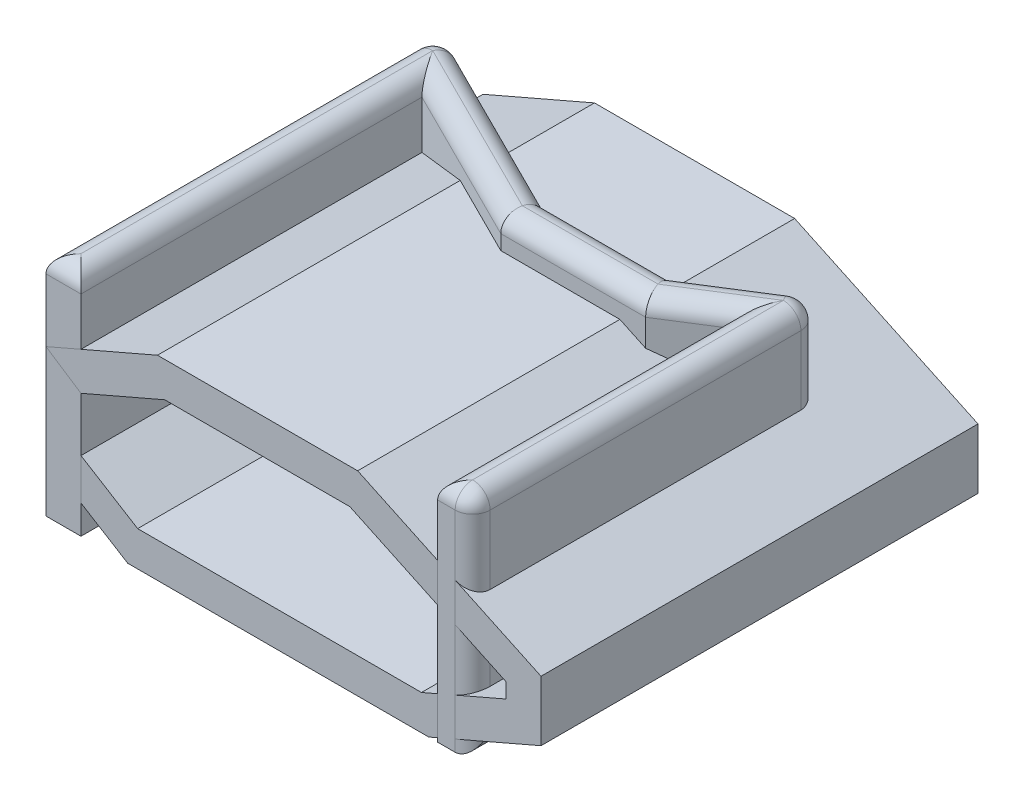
ISO-10303-21;
HEADER;
FILE_DESCRIPTION(('STEP AP214'),'2;1');
FILE_NAME('part.step','',(''),(''),'','','');
FILE_SCHEMA(('AUTOMOTIVE_DESIGN { 1 0 10303 214 1 1 1 1 }'));
ENDSEC;
DATA;
#1=APPLICATION_CONTEXT('core data for automotive mechanical design processes');
#2=APPLICATION_PROTOCOL_DEFINITION('international standard','automotive_design',2000,#1);
#3=PRODUCT_CONTEXT('',#1,'mechanical');
#4=PRODUCT('Part','Part','',(#3));
#5=PRODUCT_RELATED_PRODUCT_CATEGORY('part','',(#4));
#6=PRODUCT_DEFINITION_FORMATION('','',#4);
#7=PRODUCT_DEFINITION_CONTEXT('part definition',#1,'design');
#8=PRODUCT_DEFINITION('design','',#6,#7);
#9=PRODUCT_DEFINITION_SHAPE('','',#8);
#10=(LENGTH_UNIT() NAMED_UNIT(*) SI_UNIT(.MILLI.,.METRE.));
#11=(NAMED_UNIT(*) PLANE_ANGLE_UNIT() SI_UNIT($,.RADIAN.));
#12=(NAMED_UNIT(*) SI_UNIT($,.STERADIAN.) SOLID_ANGLE_UNIT());
#13=UNCERTAINTY_MEASURE_WITH_UNIT(LENGTH_MEASURE(1.E-05),#10,'distance_accuracy_value','');
#14=(GEOMETRIC_REPRESENTATION_CONTEXT(3) GLOBAL_UNCERTAINTY_ASSIGNED_CONTEXT((#13)) GLOBAL_UNIT_ASSIGNED_CONTEXT((#10,
#11,#12)) REPRESENTATION_CONTEXT('',''));
#15=CARTESIAN_POINT('',(0.,0.,0.));
#16=DIRECTION('',(0.,0.,1.));
#17=DIRECTION('',(1.,0.,0.));
#18=AXIS2_PLACEMENT_3D('',#15,#16,#17);
#19=CARTESIAN_POINT('',(214.068694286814,95.6244972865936,-62.7931191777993));
#20=DIRECTION('',(1.,0.,0.));
#21=DIRECTION('',(0.,0.,-1.));
#22=AXIS2_PLACEMENT_3D('',#19,#20,#21);
#23=PLANE('',#22);
#24=DIRECTION('',(0.,-1.,0.));
#25=VECTOR('',#24,1.);
#26=CARTESIAN_POINT('',(214.068694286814,95.6244972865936,125.));
#27=LINE('',#26,#25);
#28=CARTESIAN_POINT('',(214.068694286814,85.6244972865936,125.));
#29=VERTEX_POINT('',#28);
#30=CARTESIAN_POINT('',(214.068694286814,-34.3755027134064,125.));
#31=VERTEX_POINT('',#30);
#32=EDGE_CURVE('P0_E322',#29,#31,#27,.T.);
#33=ORIENTED_EDGE('',*,*,#32,.F.);
#34=DIRECTION('',(0.,0.,1.));
#35=VECTOR('',#34,1.);
#36=CARTESIAN_POINT('',(214.068694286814,85.6244972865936,-62.7931191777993));
#37=LINE('',#36,#35);
#38=CARTESIAN_POINT('',(214.068694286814,85.6244972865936,-44.6359849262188));
#39=VERTEX_POINT('',#38);
#40=EDGE_CURVE('P0_E339',#29,#39,#37,.F.);
#41=ORIENTED_EDGE('',*,*,#40,.T.);
#42=DIRECTION('',(0.,-1.,0.));
#43=VECTOR('',#42,1.);
#44=CARTESIAN_POINT('',(214.068694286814,95.6244972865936,-44.6359849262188));
#45=LINE('',#44,#43);
#46=CARTESIAN_POINT('',(214.068694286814,-34.3755027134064,-44.6359849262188));
#47=VERTEX_POINT('',#46);
#48=EDGE_CURVE('P0_E310',#39,#47,#45,.T.);
#49=ORIENTED_EDGE('',*,*,#48,.T.);
#50=DIRECTION('',(0.,0.,1.));
#51=VECTOR('',#50,1.);
#52=CARTESIAN_POINT('',(214.068694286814,-34.3755027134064,-62.7931191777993));
#53=LINE('',#52,#51);
#54=EDGE_CURVE('P0_E281',#47,#31,#53,.T.);
#55=ORIENTED_EDGE('',*,*,#54,.T.);
#56=EDGE_LOOP('',(#33,#41,#49,#55));
#57=FACE_BOUND('',#56,.T.);
#58=ADVANCED_FACE('P0_F16',(#57),#23,.F.);
#59=CARTESIAN_POINT('',(234.068694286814,95.6244972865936,125.));
#60=DIRECTION('',(0.,0.,1.));
#61=DIRECTION('',(1.,0.,0.));
#62=AXIS2_PLACEMENT_3D('',#59,#60,#61);
#63=PLANE('',#62);
#64=DIRECTION('',(0.,-1.,0.));
#65=VECTOR('',#64,1.);
#66=CARTESIAN_POINT('',(224.068694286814,95.6244972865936,125.));
#67=LINE('',#66,#65);
#68=CARTESIAN_POINT('',(224.068694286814,-34.3755027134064,125.));
#69=VERTEX_POINT('',#68);
#70=CARTESIAN_POINT('',(224.068694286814,85.6244972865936,125.));
#71=VERTEX_POINT('',#70);
#72=EDGE_CURVE('P0_E341',#69,#71,#67,.F.);
#73=ORIENTED_EDGE('',*,*,#72,.T.);
#74=DIRECTION('',(-1.,0.,0.));
#75=VECTOR('',#74,1.);
#76=CARTESIAN_POINT('',(214.068694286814,85.6244972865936,125.));
#77=LINE('',#76,#75);
#78=EDGE_CURVE('P0_E343',#71,#29,#77,.T.);
#79=ORIENTED_EDGE('',*,*,#78,.T.);
#80=ORIENTED_EDGE('',*,*,#32,.T.);
#81=DIRECTION('',(-1.,0.,0.));
#82=VECTOR('',#81,1.);
#83=CARTESIAN_POINT('',(234.068694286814,-34.3755027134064,125.));
#84=LINE('',#83,#82);
#85=EDGE_CURVE('P0_E74',#69,#31,#84,.T.);
#86=ORIENTED_EDGE('',*,*,#85,.F.);
#87=EDGE_LOOP('',(#73,#79,#80,#86));
#88=FACE_BOUND('',#87,.T.);
#89=ADVANCED_FACE('P0_F432',(#88),#63,.T.);
#90=CARTESIAN_POINT('',(234.068694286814,95.6244972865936,-62.7931191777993));
#91=DIRECTION('',(1.,0.,0.));
#92=DIRECTION('',(0.,0.,-1.));
#93=AXIS2_PLACEMENT_3D('',#90,#91,#92);
#94=PLANE('',#93);
#95=DIRECTION('',(0.,-1.,0.));
#96=VECTOR('',#95,1.);
#97=CARTESIAN_POINT('',(234.068694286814,95.6244972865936,-62.7931191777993));
#98=LINE('',#97,#96);
#99=CARTESIAN_POINT('',(234.068694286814,-24.3755027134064,-62.7931191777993));
#100=VERTEX_POINT('',#99);
#101=CARTESIAN_POINT('',(234.068694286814,85.6244972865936,-62.7931191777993));
#102=VERTEX_POINT('',#101);
#103=EDGE_CURVE('P0_E345',#100,#102,#98,.F.);
#104=ORIENTED_EDGE('',*,*,#103,.T.);
#105=DIRECTION('',(0.,0.,1.));
#106=VECTOR('',#105,1.);
#107=CARTESIAN_POINT('',(234.068694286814,85.6244972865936,125.));
#108=LINE('',#107,#106);
#109=CARTESIAN_POINT('',(234.068694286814,85.6244972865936,115.));
#110=VERTEX_POINT('',#109);
#111=EDGE_CURVE('P0_E351',#102,#110,#108,.T.);
#112=ORIENTED_EDGE('',*,*,#111,.T.);
#113=DIRECTION('',(0.,-1.,0.));
#114=VECTOR('',#113,1.);
#115=CARTESIAN_POINT('',(234.068694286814,95.6244972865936,115.));
#116=LINE('',#115,#114);
#117=CARTESIAN_POINT('',(234.068694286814,-24.3755027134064,115.));
#118=VERTEX_POINT('',#117);
#119=EDGE_CURVE('P0_E349',#110,#118,#116,.T.);
#120=ORIENTED_EDGE('',*,*,#119,.T.);
#121=DIRECTION('',(0.,0.,1.));
#122=VECTOR('',#121,1.);
#123=CARTESIAN_POINT('',(234.068694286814,-24.3755027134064,-62.7931191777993));
#124=LINE('',#123,#122);
#125=EDGE_CURVE('P0_E347',#118,#100,#124,.F.);
#126=ORIENTED_EDGE('',*,*,#125,.T.);
#127=EDGE_LOOP('',(#104,#112,#120,#126));
#128=FACE_BOUND('',#127,.T.);
#129=ADVANCED_FACE('P0_F427',(#128),#94,.T.);
#130=CARTESIAN_POINT('',(174.795427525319,95.6244972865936,-43.4609281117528));
#131=DIRECTION('',(-0.53453898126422,0.,-0.845143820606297));
#132=DIRECTION('',(-0.845143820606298,0.,0.53453898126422));
#133=AXIS2_PLACEMENT_3D('',#130,#131,#132);
#134=PLANE('',#133);
#135=DIRECTION('',(0.,-1.,0.));
#136=VECTOR('',#135,1.);
#137=CARTESIAN_POINT('',(218.723304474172,95.6244972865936,-71.2445573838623));
#138=LINE('',#137,#136);
#139=CARTESIAN_POINT('',(218.723304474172,85.6244972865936,-71.2445573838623));
#140=VERTEX_POINT('',#139);
#141=CARTESIAN_POINT('',(218.723304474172,-24.3755027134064,-71.2445573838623));
#142=VERTEX_POINT('',#141);
#143=EDGE_CURVE('P0_E362',#140,#142,#138,.T.);
#144=ORIENTED_EDGE('',*,*,#143,.T.);
#145=DIRECTION('',(0.845143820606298,0.,-0.53453898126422));
#146=VECTOR('',#145,1.);
#147=CARTESIAN_POINT('',(174.795427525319,-24.3755027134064,-43.4609281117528));
#148=LINE('',#147,#146);
#149=CARTESIAN_POINT('',(177.243812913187,-24.3755027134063,-45.0094899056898));
#150=VERTEX_POINT('',#149);
#151=EDGE_CURVE('P0_E366',#142,#150,#148,.F.);
#152=ORIENTED_EDGE('',*,*,#151,.T.);
#153=DIRECTION('',(0.,-1.,0.));
#154=VECTOR('',#153,1.);
#155=CARTESIAN_POINT('',(177.243812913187,95.6244972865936,-45.0094899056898));
#156=LINE('',#155,#154);
#157=CARTESIAN_POINT('',(177.243812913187,85.6244972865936,-45.0094899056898));
#158=VERTEX_POINT('',#157);
#159=EDGE_CURVE('P0_E173',#158,#150,#156,.T.);
#160=ORIENTED_EDGE('',*,*,#159,.F.);
#161=DIRECTION('',(0.845143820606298,0.,-0.53453898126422));
#162=VECTOR('',#161,1.);
#163=CARTESIAN_POINT('',(234.068694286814,85.6244972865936,-80.9502534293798));
#164=LINE('',#163,#162);
#165=EDGE_CURVE('P0_E364',#158,#140,#164,.T.);
#166=ORIENTED_EDGE('',*,*,#165,.T.);
#167=EDGE_LOOP('',(#144,#152,#160,#166));
#168=FACE_BOUND('',#167,.T.);
#169=ADVANCED_FACE('P0_F372',(#168),#134,.T.);
#170=CARTESIAN_POINT('',(102.511333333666,95.6244972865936,-45.0094899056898));
#171=DIRECTION('',(0.,0.,-1.));
#172=DIRECTION('',(-1.,0.,0.));
#173=AXIS2_PLACEMENT_3D('',#170,#171,#172);
#174=PLANE('',#173);
#175=ORIENTED_EDGE('',*,*,#159,.T.);
#176=DIRECTION('',(1.,0.,0.));
#177=VECTOR('',#176,1.);
#178=CARTESIAN_POINT('',(102.511333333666,-24.3755027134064,-45.0094899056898));
#179=LINE('',#178,#177);
#180=CARTESIAN_POINT('',(104.87088686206,-24.3755027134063,-45.0094899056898));
#181=VERTEX_POINT('',#180);
#182=EDGE_CURVE('P0_E167',#150,#181,#179,.F.);
#183=ORIENTED_EDGE('',*,*,#182,.T.);
#184=DIRECTION('',(0.,-1.,0.));
#185=VECTOR('',#184,1.);
#186=CARTESIAN_POINT('',(104.87088686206,95.6244972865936,-45.0094899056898));
#187=LINE('',#186,#185);
#188=CARTESIAN_POINT('',(104.87088686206,85.6244972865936,-45.0094899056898));
#189=VERTEX_POINT('',#188);
#190=EDGE_CURVE('P0_E170',#189,#181,#187,.T.);
#191=ORIENTED_EDGE('',*,*,#190,.F.);
#192=DIRECTION('',(1.,0.,0.));
#193=VECTOR('',#192,1.);
#194=CARTESIAN_POINT('',(177.243812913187,85.6244972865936,-45.0094899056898));
#195=LINE('',#194,#193);
#196=EDGE_CURVE('P0_E178',#189,#158,#195,.T.);
#197=ORIENTED_EDGE('',*,*,#196,.T.);
#198=EDGE_LOOP('',(#175,#183,#191,#197));
#199=FACE_BOUND('',#198,.T.);
#200=ADVANCED_FACE('P0_F169',(#199),#174,.T.);
#201=CARTESIAN_POINT('',(4.47022746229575,95.6244972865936,-95.1830450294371));
#202=DIRECTION('',(0.447022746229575,0.,-0.894522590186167));
#203=DIRECTION('',(-0.894522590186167,0.,-0.447022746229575));
#204=AXIS2_PLACEMENT_3D('',#201,#202,#203);
#205=PLANE('',#204);
#206=ORIENTED_EDGE('',*,*,#190,.T.);
#207=DIRECTION('',(0.894522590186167,0.,0.447022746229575));
#208=VECTOR('',#207,1.);
#209=CARTESIAN_POINT('',(4.47022746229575,-24.3755027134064,-95.1830450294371));
#210=LINE('',#209,#208);
#211=CARTESIAN_POINT('',(4.47022746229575,-24.3755027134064,-95.1830450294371));
#212=VERTEX_POINT('',#211);
#213=EDGE_CURVE('P0_E10',#181,#212,#210,.F.);
#214=ORIENTED_EDGE('',*,*,#213,.T.);
#215=DIRECTION('',(0.,-1.,0.));
#216=VECTOR('',#215,1.);
#217=CARTESIAN_POINT('',(4.47022746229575,95.6244972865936,-95.1830450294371));
#218=LINE('',#217,#216);
#219=CARTESIAN_POINT('',(4.47022746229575,85.6244972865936,-95.1830450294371));
#220=VERTEX_POINT('',#219);
#221=EDGE_CURVE('P0_E34',#212,#220,#218,.F.);
#222=ORIENTED_EDGE('',*,*,#221,.T.);
#223=DIRECTION('',(0.894522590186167,0.,0.447022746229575));
#224=VECTOR('',#223,1.);
#225=CARTESIAN_POINT('',(104.87088686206,85.6244972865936,-45.0094899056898));
#226=LINE('',#225,#224);
#227=EDGE_CURVE('P0_E26',#220,#189,#226,.T.);
#228=ORIENTED_EDGE('',*,*,#227,.T.);
#229=EDGE_LOOP('',(#206,#214,#222,#228));
#230=FACE_BOUND('',#229,.T.);
#231=ADVANCED_FACE('P0_F180',(#230),#205,.T.);
#232=CARTESIAN_POINT('',(-10.,95.6244972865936,125.));
#233=DIRECTION('',(-1.,0.,0.));
#234=DIRECTION('',(0.,0.,1.));
#235=AXIS2_PLACEMENT_3D('',#232,#233,#234);
#236=PLANE('',#235);
#237=DIRECTION('',(0.,-1.,0.));
#238=VECTOR('',#237,1.);
#239=CARTESIAN_POINT('',(-10.,95.6244972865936,125.));
#240=LINE('',#239,#238);
#241=CARTESIAN_POINT('',(-10.,85.6244972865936,125.));
#242=VERTEX_POINT('',#241);
#243=CARTESIAN_POINT('',(-10.,-34.3755027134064,125.));
#244=VERTEX_POINT('',#243);
#245=EDGE_CURVE('P0_E183',#242,#244,#240,.T.);
#246=ORIENTED_EDGE('',*,*,#245,.F.);
#247=DIRECTION('',(0.,0.,-1.));
#248=VECTOR('',#247,1.);
#249=CARTESIAN_POINT('',(-10.,85.6244972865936,-102.414299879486));
#250=LINE('',#249,#248);
#251=CARTESIAN_POINT('',(-10.,85.6244972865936,-86.2378191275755));
#252=VERTEX_POINT('',#251);
#253=EDGE_CURVE('P0_E326',#242,#252,#250,.T.);
#254=ORIENTED_EDGE('',*,*,#253,.T.);
#255=DIRECTION('',(0.,-1.,0.));
#256=VECTOR('',#255,1.);
#257=CARTESIAN_POINT('',(-10.,95.6244972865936,-86.2378191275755));
#258=LINE('',#257,#256);
#259=CARTESIAN_POINT('',(-10.,-34.3755027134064,-86.2378191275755));
#260=VERTEX_POINT('',#259);
#261=EDGE_CURVE('P0_E324',#252,#260,#258,.T.);
#262=ORIENTED_EDGE('',*,*,#261,.T.);
#263=DIRECTION('',(0.,0.,-1.));
#264=VECTOR('',#263,1.);
#265=CARTESIAN_POINT('',(-10.,-34.3755027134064,125.));
#266=LINE('',#265,#264);
#267=EDGE_CURVE('P0_E290',#244,#260,#266,.T.);
#268=ORIENTED_EDGE('',*,*,#267,.F.);
#269=EDGE_LOOP('',(#246,#254,#262,#268));
#270=FACE_BOUND('',#269,.T.);
#271=ADVANCED_FACE('P0_F682',(#270),#236,.T.);
#272=CARTESIAN_POINT('',(10.,95.6244972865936,125.));
#273=DIRECTION('',(0.,0.,1.));
#274=DIRECTION('',(1.,0.,0.));
#275=AXIS2_PLACEMENT_3D('',#272,#273,#274);
#276=PLANE('',#275);
#277=DIRECTION('',(0.,-1.,0.));
#278=VECTOR('',#277,1.);
#279=CARTESIAN_POINT('',(10.,95.6244972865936,125.));
#280=LINE('',#279,#278);
#281=CARTESIAN_POINT('',(10.,85.6244972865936,125.));
#282=VERTEX_POINT('',#281);
#283=CARTESIAN_POINT('',(10.,-34.3755027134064,125.));
#284=VERTEX_POINT('',#283);
#285=EDGE_CURVE('P0_E318',#282,#284,#280,.T.);
#286=ORIENTED_EDGE('',*,*,#285,.F.);
#287=DIRECTION('',(-1.,0.,0.));
#288=VECTOR('',#287,1.);
#289=CARTESIAN_POINT('',(-10.,85.6244972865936,125.));
#290=LINE('',#289,#288);
#291=EDGE_CURVE('P0_E329',#282,#242,#290,.T.);
#292=ORIENTED_EDGE('',*,*,#291,.T.);
#293=ORIENTED_EDGE('',*,*,#245,.T.);
#294=DIRECTION('',(-1.,0.,0.));
#295=VECTOR('',#294,1.);
#296=CARTESIAN_POINT('',(10.,-34.3755027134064,125.));
#297=LINE('',#296,#295);
#298=EDGE_CURVE('P0_E295',#284,#244,#297,.T.);
#299=ORIENTED_EDGE('',*,*,#298,.F.);
#300=EDGE_LOOP('',(#286,#292,#293,#299));
#301=FACE_BOUND('',#300,.T.);
#302=ADVANCED_FACE('P0_F674',(#301),#276,.T.);
#303=CARTESIAN_POINT('',(10.,95.6244972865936,125.));
#304=DIRECTION('',(-1.,0.,0.));
#305=DIRECTION('',(0.,0.,1.));
#306=AXIS2_PLACEMENT_3D('',#303,#304,#305);
#307=PLANE('',#306);
#308=DIRECTION('',(0.,-1.,0.));
#309=VECTOR('',#308,1.);
#310=CARTESIAN_POINT('',(10.,95.6244972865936,-70.0613383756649));
#311=LINE('',#310,#309);
#312=CARTESIAN_POINT('',(10.,85.6244972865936,-70.0613383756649));
#313=VERTEX_POINT('',#312);
#314=CARTESIAN_POINT('',(10.,-34.3755027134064,-70.0613383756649));
#315=VERTEX_POINT('',#314);
#316=EDGE_CURVE('P0_E316',#313,#315,#311,.T.);
#317=ORIENTED_EDGE('',*,*,#316,.F.);
#318=DIRECTION('',(0.,0.,-1.));
#319=VECTOR('',#318,1.);
#320=CARTESIAN_POINT('',(10.,85.6244972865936,125.));
#321=LINE('',#320,#319);
#322=EDGE_CURVE('P0_E331',#313,#282,#321,.F.);
#323=ORIENTED_EDGE('',*,*,#322,.T.);
#324=ORIENTED_EDGE('',*,*,#285,.T.);
#325=DIRECTION('',(0.,0.,-1.));
#326=VECTOR('',#325,1.);
#327=CARTESIAN_POINT('',(10.,-34.3755027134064,125.));
#328=LINE('',#327,#326);
#329=EDGE_CURVE('P0_E298',#284,#315,#328,.T.);
#330=ORIENTED_EDGE('',*,*,#329,.T.);
#331=EDGE_LOOP('',(#317,#323,#324,#330));
#332=FACE_BOUND('',#331,.T.);
#333=ADVANCED_FACE('P0_F395',(#332),#307,.F.);
#334=CARTESIAN_POINT('',(-4.47022746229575,95.6244972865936,-77.2925932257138));
#335=DIRECTION('',(0.447022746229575,0.,-0.894522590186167));
#336=DIRECTION('',(-0.894522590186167,0.,-0.447022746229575));
#337=AXIS2_PLACEMENT_3D('',#334,#335,#336);
#338=PLANE('',#337);
#339=DIRECTION('',(0.,-1.,0.));
#340=VECTOR('',#339,1.);
#341=CARTESIAN_POINT('',(100.151779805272,95.6244972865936,-25.0094899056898));
#342=LINE('',#341,#340);
#343=CARTESIAN_POINT('',(100.151779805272,85.6244972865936,-25.0094899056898));
#344=VERTEX_POINT('',#343);
#345=CARTESIAN_POINT('',(100.151779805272,-34.3755027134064,-25.0094899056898));
#346=VERTEX_POINT('',#345);
#347=EDGE_CURVE('P0_E314',#344,#346,#342,.T.);
#348=ORIENTED_EDGE('',*,*,#347,.F.);
#349=DIRECTION('',(0.894522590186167,0.,0.447022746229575));
#350=VECTOR('',#349,1.);
#351=CARTESIAN_POINT('',(-4.47022746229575,85.6244972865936,-77.2925932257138));
#352=LINE('',#351,#350);
#353=EDGE_CURVE('P0_E333',#344,#313,#352,.F.);
#354=ORIENTED_EDGE('',*,*,#353,.T.);
#355=ORIENTED_EDGE('',*,*,#316,.T.);
#356=DIRECTION('',(0.894522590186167,0.,0.447022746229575));
#357=VECTOR('',#356,1.);
#358=CARTESIAN_POINT('',(-4.47022746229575,-34.3755027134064,-77.2925932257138));
#359=LINE('',#358,#357);
#360=EDGE_CURVE('P0_E301',#315,#346,#359,.T.);
#361=ORIENTED_EDGE('',*,*,#360,.T.);
#362=EDGE_LOOP('',(#348,#354,#355,#361));
#363=FACE_BOUND('',#362,.T.);
#364=ADVANCED_FACE('P0_F393',(#363),#338,.F.);
#365=CARTESIAN_POINT('',(102.511333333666,95.6244972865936,-25.0094899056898));
#366=DIRECTION('',(0.,0.,-1.));
#367=DIRECTION('',(-1.,0.,0.));
#368=AXIS2_PLACEMENT_3D('',#365,#366,#367);
#369=PLANE('',#368);
#370=DIRECTION('',(0.,-1.,0.));
#371=VECTOR('',#370,1.);
#372=CARTESIAN_POINT('',(183.037821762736,95.6244972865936,-25.0094899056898));
#373=LINE('',#372,#371);
#374=CARTESIAN_POINT('',(183.037821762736,85.6244972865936,-25.0094899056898));
#375=VERTEX_POINT('',#374);
#376=CARTESIAN_POINT('',(183.037821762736,-34.3755027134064,-25.0094899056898));
#377=VERTEX_POINT('',#376);
#378=EDGE_CURVE('P0_E312',#375,#377,#373,.T.);
#379=ORIENTED_EDGE('',*,*,#378,.F.);
#380=DIRECTION('',(1.,0.,0.));
#381=VECTOR('',#380,1.);
#382=CARTESIAN_POINT('',(102.511333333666,85.6244972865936,-25.0094899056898));
#383=LINE('',#382,#381);
#384=EDGE_CURVE('P0_E335',#375,#344,#383,.F.);
#385=ORIENTED_EDGE('',*,*,#384,.T.);
#386=ORIENTED_EDGE('',*,*,#347,.T.);
#387=DIRECTION('',(1.,0.,0.));
#388=VECTOR('',#387,1.);
#389=CARTESIAN_POINT('',(102.511333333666,-34.3755027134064,-25.0094899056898));
#390=LINE('',#389,#388);
#391=EDGE_CURVE('P0_E304',#346,#377,#390,.T.);
#392=ORIENTED_EDGE('',*,*,#391,.T.);
#393=EDGE_LOOP('',(#379,#385,#386,#392));
#394=FACE_BOUND('',#393,.T.);
#395=ADVANCED_FACE('P0_F405',(#394),#369,.F.);
#396=CARTESIAN_POINT('',(185.486207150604,95.6244972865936,-26.5580516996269));
#397=DIRECTION('',(-0.53453898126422,0.,-0.845143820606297));
#398=DIRECTION('',(-0.845143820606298,0.,0.53453898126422));
#399=AXIS2_PLACEMENT_3D('',#396,#397,#398);
#400=PLANE('',#399);
#401=ORIENTED_EDGE('',*,*,#48,.F.);
#402=DIRECTION('',(0.845143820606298,0.,-0.53453898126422));
#403=VECTOR('',#402,1.);
#404=CARTESIAN_POINT('',(185.486207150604,85.6244972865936,-26.5580516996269));
#405=LINE('',#404,#403);
#406=EDGE_CURVE('P0_E337',#39,#375,#405,.F.);
#407=ORIENTED_EDGE('',*,*,#406,.T.);
#408=ORIENTED_EDGE('',*,*,#378,.T.);
#409=DIRECTION('',(0.845143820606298,0.,-0.53453898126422));
#410=VECTOR('',#409,1.);
#411=CARTESIAN_POINT('',(185.486207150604,-34.3755027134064,-26.5580516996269));
#412=LINE('',#411,#410);
#413=EDGE_CURVE('P0_E307',#377,#47,#412,.T.);
#414=ORIENTED_EDGE('',*,*,#413,.T.);
#415=EDGE_LOOP('',(#401,#407,#408,#414));
#416=FACE_BOUND('',#415,.T.);
#417=ADVANCED_FACE('P0_F645',(#416),#400,.F.);
#418=CARTESIAN_POINT('',(164.899293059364,-34.3755027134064,-50.7574820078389));
#419=DIRECTION('',(0.,-1.,0.));
#420=DIRECTION('',(0.,0.,1.));
#421=AXIS2_PLACEMENT_3D('',#418,#419,#420);
#422=PLANE('',#421);
#423=DIRECTION('',(0.845143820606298,0.,-0.53453898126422));
#424=VECTOR('',#423,1.);
#425=CARTESIAN_POINT('',(176.368632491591,-34.3755027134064,-32.623647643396));
#426=LINE('',#425,#424);
#427=CARTESIAN_POINT('',(180.140817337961,-34.3755027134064,-35.0094899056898));
#428=VERTEX_POINT('',#427);
#429=CARTESIAN_POINT('',(224.068694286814,-34.3755027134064,-62.7931191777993));
#430=VERTEX_POINT('',#429);
#431=EDGE_CURVE('P0_E358',#428,#430,#426,.T.);
#432=ORIENTED_EDGE('',*,*,#431,.T.);
#433=DIRECTION('',(0.,0.,1.));
#434=VECTOR('',#433,1.);
#435=CARTESIAN_POINT('',(224.068694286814,-34.3755027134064,-50.7574820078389));
#436=LINE('',#435,#434);
#437=EDGE_CURVE('P0_E360',#430,#69,#436,.T.);
#438=ORIENTED_EDGE('',*,*,#437,.T.);
#439=ORIENTED_EDGE('',*,*,#85,.T.);
#440=ORIENTED_EDGE('',*,*,#54,.F.);
#441=ORIENTED_EDGE('',*,*,#413,.F.);
#442=ORIENTED_EDGE('',*,*,#391,.F.);
#443=ORIENTED_EDGE('',*,*,#360,.F.);
#444=ORIENTED_EDGE('',*,*,#329,.F.);
#445=ORIENTED_EDGE('',*,*,#298,.T.);
#446=ORIENTED_EDGE('',*,*,#267,.T.);
#447=CARTESIAN_POINT('',(0.,-34.3755027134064,-86.2378191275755));
#448=DIRECTION('',(0.,-1.,0.));
#449=DIRECTION('',(-1.,0.,0.));
#450=AXIS2_PLACEMENT_3D('',#447,#448,#449);
#451=CIRCLE('',#450,10.);
#452=CARTESIAN_POINT('',(-8.94522590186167,-34.3755027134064,-90.7080465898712));
#453=VERTEX_POINT('',#452);
#454=EDGE_CURVE('P0_E354',#260,#453,#451,.T.);
#455=ORIENTED_EDGE('',*,*,#454,.T.);
#456=DIRECTION('',(0.894522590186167,0.,0.447022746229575));
#457=VECTOR('',#456,1.);
#458=CARTESIAN_POINT('',(146.135168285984,-34.3755027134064,-13.209205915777));
#459=LINE('',#458,#457);
#460=CARTESIAN_POINT('',(102.511333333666,-34.3755027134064,-35.0094899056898));
#461=VERTEX_POINT('',#460);
#462=EDGE_CURVE('P0_E198',#453,#461,#459,.T.);
#463=ORIENTED_EDGE('',*,*,#462,.T.);
#464=DIRECTION('',(1.,0.,0.));
#465=VECTOR('',#464,1.);
#466=CARTESIAN_POINT('',(164.899293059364,-34.3755027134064,-35.0094899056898));
#467=LINE('',#466,#465);
#468=EDGE_CURVE('P0_E189',#461,#428,#467,.T.);
#469=ORIENTED_EDGE('',*,*,#468,.T.);
#470=EDGE_LOOP('',(#432,#438,#439,#440,#441,#442,#443,#444,#445,#446,#455,#463,#469));
#471=FACE_BOUND('',#470,.T.);
#472=ADVANCED_FACE('P0_F401',(#471),#422,.T.);
#473=CARTESIAN_POINT('',(224.068694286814,95.6244972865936,115.));
#474=DIRECTION('',(0.,-1.,0.));
#475=DIRECTION('',(-1.,0.,0.));
#476=AXIS2_PLACEMENT_3D('',#473,#474,#475);
#477=CYLINDRICAL_SURFACE('',#476,10.);
#478=CARTESIAN_POINT('',(224.068694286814,85.6244972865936,115.));
#479=DIRECTION('',(0.,1.,0.));
#480=DIRECTION('',(1.,0.,0.));
#481=AXIS2_PLACEMENT_3D('',#478,#479,#480);
#482=CIRCLE('',#481,10.);
#483=EDGE_CURVE('P0_E275',#71,#110,#482,.T.);
#484=ORIENTED_EDGE('',*,*,#483,.F.);
#485=ORIENTED_EDGE('',*,*,#72,.F.);
#486=CARTESIAN_POINT('',(224.068694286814,-24.3755027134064,115.));
#487=DIRECTION('',(0.,0.707106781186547,0.707106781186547));
#488=DIRECTION('',(0.,-0.707106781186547,0.707106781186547));
#489=AXIS2_PLACEMENT_3D('',#486,#487,#488);
#490=ELLIPSE('',#489,14.1421356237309,10.);
#491=EDGE_CURVE('P0_E20',#118,#69,#490,.F.);
#492=ORIENTED_EDGE('',*,*,#491,.F.);
#493=ORIENTED_EDGE('',*,*,#119,.F.);
#494=EDGE_LOOP('',(#484,#485,#492,#493));
#495=FACE_BOUND('',#494,.T.);
#496=ADVANCED_FACE('P0_F18',(#495),#477,.T.);
#497=CARTESIAN_POINT('',(224.068694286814,-24.3755027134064,-50.7574820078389));
#498=DIRECTION('',(0.,0.,1.));
#499=DIRECTION('',(1.,0.,0.));
#500=AXIS2_PLACEMENT_3D('',#497,#498,#499);
#501=CYLINDRICAL_SURFACE('',#500,10.);
#502=ORIENTED_EDGE('',*,*,#491,.T.);
#503=ORIENTED_EDGE('',*,*,#437,.F.);
#504=CARTESIAN_POINT('',(224.068694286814,-24.3755027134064,-62.7931191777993));
#505=DIRECTION('',(0.,0.,-1.));
#506=DIRECTION('',(0.,1.,0.));
#507=AXIS2_PLACEMENT_3D('',#504,#505,#506);
#508=CIRCLE('',#507,10.);
#509=EDGE_CURVE('P0_E272',#100,#430,#508,.T.);
#510=ORIENTED_EDGE('',*,*,#509,.F.);
#511=ORIENTED_EDGE('',*,*,#125,.F.);
#512=EDGE_LOOP('',(#502,#503,#510,#511));
#513=FACE_BOUND('',#512,.T.);
#514=ADVANCED_FACE('P0_F425',(#513),#501,.T.);
#515=CARTESIAN_POINT('',(224.068694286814,85.6244972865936,115.));
#516=DIRECTION('',(1.,0.,0.));
#517=DIRECTION('',(0.,0.,-1.));
#518=AXIS2_PLACEMENT_3D('',#515,#516,#517);
#519=SPHERICAL_SURFACE('',#518,10.);
#520=CARTESIAN_POINT('',(224.068694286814,85.6244972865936,115.));
#521=DIRECTION('',(1.,0.,0.));
#522=DIRECTION('',(0.,0.,-1.));
#523=AXIS2_PLACEMENT_3D('',#520,#521,#522);
#524=CIRCLE('',#523,10.);
#525=CARTESIAN_POINT('',(224.068694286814,95.6244972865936,115.));
#526=VERTEX_POINT('',#525);
#527=EDGE_CURVE('P0_E65',#71,#526,#524,.F.);
#528=ORIENTED_EDGE('',*,*,#527,.F.);
#529=ORIENTED_EDGE('',*,*,#483,.T.);
#530=CARTESIAN_POINT('',(224.068694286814,85.6244972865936,115.));
#531=DIRECTION('',(0.,0.,1.));
#532=DIRECTION('',(1.,0.,0.));
#533=AXIS2_PLACEMENT_3D('',#530,#531,#532);
#534=CIRCLE('',#533,10.);
#535=EDGE_CURVE('P0_E267',#526,#110,#534,.F.);
#536=ORIENTED_EDGE('',*,*,#535,.F.);
#537=EDGE_LOOP('',(#528,#529,#536));
#538=FACE_BOUND('',#537,.T.);
#539=ADVANCED_FACE('P0_F618',(#538),#519,.T.);
#540=CARTESIAN_POINT('',(234.068694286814,85.6244972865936,115.));
#541=DIRECTION('',(1.,0.,0.));
#542=DIRECTION('',(0.,0.,-1.));
#543=AXIS2_PLACEMENT_3D('',#540,#541,#542);
#544=CYLINDRICAL_SURFACE('',#543,10.);
#545=ORIENTED_EDGE('',*,*,#78,.F.);
#546=ORIENTED_EDGE('',*,*,#527,.T.);
#547=CARTESIAN_POINT('',(224.068694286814,85.6244972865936,115.));
#548=DIRECTION('',(0.707106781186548,0.,0.707106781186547));
#549=DIRECTION('',(0.707106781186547,0.,-0.707106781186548));
#550=AXIS2_PLACEMENT_3D('',#547,#548,#549);
#551=ELLIPSE('',#550,14.1421356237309,10.);
#552=EDGE_CURVE('P0_E264',#29,#526,#551,.F.);
#553=ORIENTED_EDGE('',*,*,#552,.F.);
#554=EDGE_LOOP('',(#545,#546,#553));
#555=FACE_BOUND('',#554,.T.);
#556=ADVANCED_FACE('P0_F434',(#555),#544,.T.);
#557=CARTESIAN_POINT('',(224.068694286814,-24.3755027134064,-62.7931191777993));
#558=DIRECTION('',(1.,0.,0.));
#559=DIRECTION('',(0.,0.,-1.));
#560=AXIS2_PLACEMENT_3D('',#557,#558,#559);
#561=SPHERICAL_SURFACE('',#560,10.);
#562=CARTESIAN_POINT('',(224.068694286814,-24.3755027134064,-62.7931191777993));
#563=DIRECTION('',(0.845143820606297,0.,-0.534538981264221));
#564=DIRECTION('',(-0.534538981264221,0.,-0.845143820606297));
#565=AXIS2_PLACEMENT_3D('',#562,#563,#564);
#566=CIRCLE('',#565,10.);
#567=EDGE_CURVE('P0_E261',#142,#430,#566,.F.);
#568=ORIENTED_EDGE('',*,*,#567,.F.);
#569=CARTESIAN_POINT('',(224.068694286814,-24.3755027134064,-62.7931191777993));
#570=DIRECTION('',(0.,-1.,0.));
#571=DIRECTION('',(-1.,0.,0.));
#572=AXIS2_PLACEMENT_3D('',#569,#570,#571);
#573=CIRCLE('',#572,10.);
#574=EDGE_CURVE('P0_E269',#100,#142,#573,.F.);
#575=ORIENTED_EDGE('',*,*,#574,.F.);
#576=ORIENTED_EDGE('',*,*,#509,.T.);
#577=EDGE_LOOP('',(#568,#575,#576));
#578=FACE_BOUND('',#577,.T.);
#579=ADVANCED_FACE('P0_F420',(#578),#561,.T.);
#580=CARTESIAN_POINT('',(224.068694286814,95.6244972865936,-62.7931191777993));
#581=DIRECTION('',(0.,-1.,0.));
#582=DIRECTION('',(-1.,0.,0.));
#583=AXIS2_PLACEMENT_3D('',#580,#581,#582);
#584=CYLINDRICAL_SURFACE('',#583,10.);
#585=ORIENTED_EDGE('',*,*,#574,.T.);
#586=ORIENTED_EDGE('',*,*,#143,.F.);
#587=CARTESIAN_POINT('',(224.068694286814,85.6244972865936,-62.7931191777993));
#588=DIRECTION('',(0.,1.,0.));
#589=DIRECTION('',(1.,0.,0.));
#590=AXIS2_PLACEMENT_3D('',#587,#588,#589);
#591=CIRCLE('',#590,10.);
#592=EDGE_CURVE('P0_E258',#102,#140,#591,.T.);
#593=ORIENTED_EDGE('',*,*,#592,.F.);
#594=ORIENTED_EDGE('',*,*,#103,.F.);
#595=EDGE_LOOP('',(#585,#586,#593,#594));
#596=FACE_BOUND('',#595,.T.);
#597=ADVANCED_FACE('P0_F416',(#596),#584,.T.);
#598=CARTESIAN_POINT('',(224.068694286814,85.6244972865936,-62.7931191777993));
#599=DIRECTION('',(0.,0.,-1.));
#600=DIRECTION('',(-1.,0.,0.));
#601=AXIS2_PLACEMENT_3D('',#598,#599,#600);
#602=CYLINDRICAL_SURFACE('',#601,10.);
#603=DIRECTION('',(0.,0.,1.));
#604=VECTOR('',#603,1.);
#605=CARTESIAN_POINT('',(224.068694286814,95.6244972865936,-80.9502534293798));
#606=LINE('',#605,#604);
#607=CARTESIAN_POINT('',(224.068694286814,95.6244972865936,-62.7931191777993));
#608=VERTEX_POINT('',#607);
#609=EDGE_CURVE('P0_E57',#526,#608,#606,.F.);
#610=ORIENTED_EDGE('',*,*,#609,.F.);
#611=ORIENTED_EDGE('',*,*,#535,.T.);
#612=ORIENTED_EDGE('',*,*,#111,.F.);
#613=CARTESIAN_POINT('',(224.068694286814,85.6244972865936,-62.7931191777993));
#614=DIRECTION('',(0.,0.,-1.));
#615=DIRECTION('',(-1.,0.,0.));
#616=AXIS2_PLACEMENT_3D('',#613,#614,#615);
#617=CIRCLE('',#616,10.);
#618=EDGE_CURVE('P0_E255',#608,#102,#617,.T.);
#619=ORIENTED_EDGE('',*,*,#618,.F.);
#620=EDGE_LOOP('',(#610,#611,#612,#619));
#621=FACE_BOUND('',#620,.T.);
#622=ADVANCED_FACE('P0_F437',(#621),#602,.T.);
#623=CARTESIAN_POINT('',(224.068694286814,85.6244972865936,-50.7574820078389));
#624=DIRECTION('',(0.,0.,1.));
#625=DIRECTION('',(1.,0.,0.));
#626=AXIS2_PLACEMENT_3D('',#623,#624,#625);
#627=CYLINDRICAL_SURFACE('',#626,10.);
#628=ORIENTED_EDGE('',*,*,#552,.T.);
#629=ORIENTED_EDGE('',*,*,#609,.T.);
#630=CARTESIAN_POINT('',(224.068694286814,85.6244972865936,-62.7931191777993));
#631=DIRECTION('',(0.875939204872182,0.,0.482421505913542));
#632=DIRECTION('',(0.482421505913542,0.,-0.875939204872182));
#633=AXIS2_PLACEMENT_3D('',#630,#631,#632);
#634=ELLIPSE('',#633,20.7287607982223,10.);
#635=EDGE_CURVE('P0_E252',#39,#608,#634,.F.);
#636=ORIENTED_EDGE('',*,*,#635,.F.);
#637=ORIENTED_EDGE('',*,*,#40,.F.);
#638=EDGE_LOOP('',(#628,#629,#636,#637));
#639=FACE_BOUND('',#638,.T.);
#640=ADVANCED_FACE('P0_F435',(#639),#627,.T.);
#641=CARTESIAN_POINT('',(176.368632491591,-24.3755027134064,-32.623647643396));
#642=DIRECTION('',(0.845143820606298,0.,-0.53453898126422));
#643=DIRECTION('',(-0.53453898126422,0.,-0.845143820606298));
#644=AXIS2_PLACEMENT_3D('',#641,#642,#643);
#645=CYLINDRICAL_SURFACE('',#644,10.);
#646=ORIENTED_EDGE('',*,*,#567,.T.);
#647=ORIENTED_EDGE('',*,*,#431,.F.);
#648=CARTESIAN_POINT('',(180.140817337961,-24.3755027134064,-35.0094899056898));
#649=DIRECTION('',(0.960506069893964,0.,-0.278259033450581));
#650=DIRECTION('',(-0.27825903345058,0.,-0.960506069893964));
#651=AXIS2_PLACEMENT_3D('',#648,#649,#650);
#652=ELLIPSE('',#651,10.4111783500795,10.);
#653=EDGE_CURVE('P0_E250',#150,#428,#652,.F.);
#654=ORIENTED_EDGE('',*,*,#653,.F.);
#655=ORIENTED_EDGE('',*,*,#151,.F.);
#656=EDGE_LOOP('',(#646,#647,#654,#655));
#657=FACE_BOUND('',#656,.T.);
#658=ADVANCED_FACE('P0_F424',(#657),#645,.T.);
#659=CARTESIAN_POINT('',(224.068694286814,85.6244972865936,-62.7931191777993));
#660=DIRECTION('',(1.,0.,0.));
#661=DIRECTION('',(0.,0.,-1.));
#662=AXIS2_PLACEMENT_3D('',#659,#660,#661);
#663=SPHERICAL_SURFACE('',#662,10.);
#664=ORIENTED_EDGE('',*,*,#618,.T.);
#665=ORIENTED_EDGE('',*,*,#592,.T.);
#666=CARTESIAN_POINT('',(224.068694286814,85.6244972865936,-62.7931191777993));
#667=DIRECTION('',(0.845143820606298,0.,-0.53453898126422));
#668=DIRECTION('',(-0.53453898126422,0.,-0.845143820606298));
#669=AXIS2_PLACEMENT_3D('',#666,#667,#668);
#670=CIRCLE('',#669,10.);
#671=EDGE_CURVE('P0_E247',#608,#140,#670,.F.);
#672=ORIENTED_EDGE('',*,*,#671,.F.);
#673=EDGE_LOOP('',(#664,#665,#672));
#674=FACE_BOUND('',#673,.T.);
#675=ADVANCED_FACE('P0_F412',(#674),#663,.T.);
#676=CARTESIAN_POINT('',(176.368632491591,85.6244972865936,-32.623647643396));
#677=DIRECTION('',(0.845143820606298,0.,-0.53453898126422));
#678=DIRECTION('',(-0.53453898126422,0.,-0.845143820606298));
#679=AXIS2_PLACEMENT_3D('',#676,#677,#678);
#680=CYLINDRICAL_SURFACE('',#679,10.);
#681=ORIENTED_EDGE('',*,*,#406,.F.);
#682=ORIENTED_EDGE('',*,*,#635,.T.);
#683=DIRECTION('',(0.845143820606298,0.,-0.53453898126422));
#684=VECTOR('',#683,1.);
#685=CARTESIAN_POINT('',(176.368632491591,95.6244972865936,-32.623647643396));
#686=LINE('',#685,#684);
#687=CARTESIAN_POINT('',(180.140817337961,95.6244972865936,-35.0094899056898));
#688=VERTEX_POINT('',#687);
#689=EDGE_CURVE('P0_E244',#688,#608,#686,.T.);
#690=ORIENTED_EDGE('',*,*,#689,.F.);
#691=CARTESIAN_POINT('',(180.140817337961,85.6244972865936,-35.0094899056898));
#692=DIRECTION('',(0.960506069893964,0.,-0.278259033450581));
#693=DIRECTION('',(-0.27825903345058,0.,-0.960506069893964));
#694=AXIS2_PLACEMENT_3D('',#691,#692,#693);
#695=ELLIPSE('',#694,10.4111783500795,10.);
#696=EDGE_CURVE('P0_E192',#375,#688,#695,.F.);
#697=ORIENTED_EDGE('',*,*,#696,.F.);
#698=EDGE_LOOP('',(#681,#682,#690,#697));
#699=FACE_BOUND('',#698,.T.);
#700=ADVANCED_FACE('P0_F409',(#699),#680,.T.);
#701=CARTESIAN_POINT('',(164.899293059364,-24.3755027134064,-35.0094899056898));
#702=DIRECTION('',(1.,0.,0.));
#703=DIRECTION('',(0.,0.,-1.));
#704=AXIS2_PLACEMENT_3D('',#701,#702,#703);
#705=CYLINDRICAL_SURFACE('',#704,10.);
#706=ORIENTED_EDGE('',*,*,#653,.T.);
#707=ORIENTED_EDGE('',*,*,#468,.F.);
#708=CARTESIAN_POINT('',(102.511333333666,-24.3755027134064,-35.0094899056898));
#709=DIRECTION('',(0.973273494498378,0.,0.229649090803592));
#710=DIRECTION('',(0.229649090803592,0.,-0.973273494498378));
#711=AXIS2_PLACEMENT_3D('',#708,#709,#710);
#712=ELLIPSE('',#711,10.2746042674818,10.);
#713=EDGE_CURVE('P0_E187',#181,#461,#712,.F.);
#714=ORIENTED_EDGE('',*,*,#713,.F.);
#715=ORIENTED_EDGE('',*,*,#182,.F.);
#716=EDGE_LOOP('',(#706,#707,#714,#715));
#717=FACE_BOUND('',#716,.T.);
#718=ADVANCED_FACE('P0_F188',(#717),#705,.T.);
#719=CARTESIAN_POINT('',(180.140817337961,85.6244972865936,-35.0094899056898));
#720=DIRECTION('',(-0.845143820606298,0.,0.53453898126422));
#721=DIRECTION('',(0.53453898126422,0.,0.845143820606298));
#722=AXIS2_PLACEMENT_3D('',#719,#720,#721);
#723=CYLINDRICAL_SURFACE('',#722,10.);
#724=ORIENTED_EDGE('',*,*,#671,.T.);
#725=ORIENTED_EDGE('',*,*,#165,.F.);
#726=CARTESIAN_POINT('',(180.140817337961,85.6244972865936,-35.0094899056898));
#727=DIRECTION('',(-0.960506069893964,0.,0.278259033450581));
#728=DIRECTION('',(-0.27825903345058,0.,-0.960506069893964));
#729=AXIS2_PLACEMENT_3D('',#726,#727,#728);
#730=ELLIPSE('',#729,10.4111783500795,10.);
#731=EDGE_CURVE('P0_E193',#688,#158,#730,.T.);
#732=ORIENTED_EDGE('',*,*,#731,.F.);
#733=ORIENTED_EDGE('',*,*,#689,.T.);
#734=EDGE_LOOP('',(#724,#725,#732,#733));
#735=FACE_BOUND('',#734,.T.);
#736=ADVANCED_FACE('P0_F377',(#735),#723,.T.);
#737=CARTESIAN_POINT('',(164.899293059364,85.6244972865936,-35.0094899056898));
#738=DIRECTION('',(1.,0.,0.));
#739=DIRECTION('',(0.,0.,-1.));
#740=AXIS2_PLACEMENT_3D('',#737,#738,#739);
#741=CYLINDRICAL_SURFACE('',#740,10.);
#742=ORIENTED_EDGE('',*,*,#384,.F.);
#743=ORIENTED_EDGE('',*,*,#696,.T.);
#744=DIRECTION('',(1.,0.,0.));
#745=VECTOR('',#744,1.);
#746=CARTESIAN_POINT('',(164.899293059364,95.6244972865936,-35.0094899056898));
#747=LINE('',#746,#745);
#748=CARTESIAN_POINT('',(102.511333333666,95.6244972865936,-35.0094899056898));
#749=VERTEX_POINT('',#748);
#750=EDGE_CURVE('P0_E237',#749,#688,#747,.T.);
#751=ORIENTED_EDGE('',*,*,#750,.F.);
#752=CARTESIAN_POINT('',(102.511333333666,85.6244972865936,-35.0094899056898));
#753=DIRECTION('',(0.973273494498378,0.,0.229649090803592));
#754=DIRECTION('',(0.229649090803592,0.,-0.973273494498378));
#755=AXIS2_PLACEMENT_3D('',#752,#753,#754);
#756=ELLIPSE('',#755,10.2746042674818,10.);
#757=EDGE_CURVE('P0_E201',#344,#749,#756,.F.);
#758=ORIENTED_EDGE('',*,*,#757,.F.);
#759=EDGE_LOOP('',(#742,#743,#751,#758));
#760=FACE_BOUND('',#759,.T.);
#761=ADVANCED_FACE('P0_F383',(#760),#741,.T.);
#762=CARTESIAN_POINT('',(146.135168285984,-24.3755027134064,-13.209205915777));
#763=DIRECTION('',(0.894522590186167,0.,0.447022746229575));
#764=DIRECTION('',(0.447022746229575,0.,-0.894522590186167));
#765=AXIS2_PLACEMENT_3D('',#762,#763,#764);
#766=CYLINDRICAL_SURFACE('',#765,10.);
#767=ORIENTED_EDGE('',*,*,#713,.T.);
#768=ORIENTED_EDGE('',*,*,#462,.F.);
#769=CARTESIAN_POINT('',(0.,-24.3755027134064,-86.2378191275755));
#770=DIRECTION('',(0.632522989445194,-0.707106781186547,0.316092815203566));
#771=DIRECTION('',(-0.632522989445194,-0.707106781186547,-0.316092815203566));
#772=AXIS2_PLACEMENT_3D('',#769,#770,#771);
#773=ELLIPSE('',#772,14.1421356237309,10.);
#774=EDGE_CURVE('P0_E197',#212,#453,#773,.F.);
#775=ORIENTED_EDGE('',*,*,#774,.F.);
#776=ORIENTED_EDGE('',*,*,#213,.F.);
#777=EDGE_LOOP('',(#767,#768,#775,#776));
#778=FACE_BOUND('',#777,.T.);
#779=ADVANCED_FACE('P0_F195',(#778),#766,.T.);
#780=CARTESIAN_POINT('',(102.511333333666,85.6244972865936,-35.0094899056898));
#781=DIRECTION('',(-1.,0.,0.));
#782=DIRECTION('',(0.,0.,1.));
#783=AXIS2_PLACEMENT_3D('',#780,#781,#782);
#784=CYLINDRICAL_SURFACE('',#783,10.);
#785=ORIENTED_EDGE('',*,*,#731,.T.);
#786=ORIENTED_EDGE('',*,*,#196,.F.);
#787=CARTESIAN_POINT('',(102.511333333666,85.6244972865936,-35.0094899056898));
#788=DIRECTION('',(-0.973273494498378,0.,-0.229649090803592));
#789=DIRECTION('',(0.229649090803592,0.,-0.973273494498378));
#790=AXIS2_PLACEMENT_3D('',#787,#788,#789);
#791=ELLIPSE('',#790,10.2746042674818,10.);
#792=EDGE_CURVE('P0_E202',#749,#189,#791,.T.);
#793=ORIENTED_EDGE('',*,*,#792,.F.);
#794=ORIENTED_EDGE('',*,*,#750,.T.);
#795=EDGE_LOOP('',(#785,#786,#793,#794));
#796=FACE_BOUND('',#795,.T.);
#797=ADVANCED_FACE('P0_F379',(#796),#784,.T.);
#798=CARTESIAN_POINT('',(146.135168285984,85.6244972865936,-13.209205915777));
#799=DIRECTION('',(0.894522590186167,0.,0.447022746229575));
#800=DIRECTION('',(0.447022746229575,0.,-0.894522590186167));
#801=AXIS2_PLACEMENT_3D('',#798,#799,#800);
#802=CYLINDRICAL_SURFACE('',#801,10.);
#803=ORIENTED_EDGE('',*,*,#353,.F.);
#804=ORIENTED_EDGE('',*,*,#757,.T.);
#805=DIRECTION('',(0.894522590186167,0.,0.447022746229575));
#806=VECTOR('',#805,1.);
#807=CARTESIAN_POINT('',(146.135168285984,95.6244972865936,-13.209205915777));
#808=LINE('',#807,#806);
#809=CARTESIAN_POINT('',(0.,95.6244972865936,-86.2378191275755));
#810=VERTEX_POINT('',#809);
#811=EDGE_CURVE('P0_E230',#810,#749,#808,.T.);
#812=ORIENTED_EDGE('',*,*,#811,.F.);
#813=CARTESIAN_POINT('',(0.,85.6244972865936,-86.2378191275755));
#814=DIRECTION('',(0.850594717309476,0.,-0.525821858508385));
#815=DIRECTION('',(-0.525821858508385,0.,-0.850594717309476));
#816=AXIS2_PLACEMENT_3D('',#813,#814,#815);
#817=ELLIPSE('',#816,19.0178476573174,10.);
#818=EDGE_CURVE('P0_E227',#313,#810,#817,.F.);
#819=ORIENTED_EDGE('',*,*,#818,.F.);
#820=EDGE_LOOP('',(#803,#804,#812,#819));
#821=FACE_BOUND('',#820,.T.);
#822=ADVANCED_FACE('P0_F387',(#821),#802,.T.);
#823=CARTESIAN_POINT('',(0.,95.6244972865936,-86.2378191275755));
#824=DIRECTION('',(0.,-1.,0.));
#825=DIRECTION('',(-1.,0.,0.));
#826=AXIS2_PLACEMENT_3D('',#823,#824,#825);
#827=CYLINDRICAL_SURFACE('',#826,10.);
#828=ORIENTED_EDGE('',*,*,#454,.F.);
#829=ORIENTED_EDGE('',*,*,#261,.F.);
#830=CARTESIAN_POINT('',(0.,85.6244972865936,-86.2378191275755));
#831=DIRECTION('',(0.,1.,0.));
#832=DIRECTION('',(1.,0.,0.));
#833=AXIS2_PLACEMENT_3D('',#830,#831,#832);
#834=CIRCLE('',#833,10.);
#835=EDGE_CURVE('P0_E208',#220,#252,#834,.T.);
#836=ORIENTED_EDGE('',*,*,#835,.F.);
#837=ORIENTED_EDGE('',*,*,#221,.F.);
#838=ORIENTED_EDGE('',*,*,#774,.T.);
#839=EDGE_LOOP('',(#828,#829,#836,#837,#838));
#840=FACE_BOUND('',#839,.T.);
#841=ADVANCED_FACE('P0_F205',(#840),#827,.T.);
#842=CARTESIAN_POINT('',(0.,85.6244972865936,-86.2378191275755));
#843=DIRECTION('',(-0.894522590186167,0.,-0.447022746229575));
#844=DIRECTION('',(-0.447022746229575,0.,0.894522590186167));
#845=AXIS2_PLACEMENT_3D('',#842,#843,#844);
#846=CYLINDRICAL_SURFACE('',#845,10.);
#847=ORIENTED_EDGE('',*,*,#792,.T.);
#848=ORIENTED_EDGE('',*,*,#227,.F.);
#849=CARTESIAN_POINT('',(0.,85.6244972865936,-86.2378191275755));
#850=DIRECTION('',(-0.894522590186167,0.,-0.447022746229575));
#851=DIRECTION('',(-0.447022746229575,0.,0.894522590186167));
#852=AXIS2_PLACEMENT_3D('',#849,#850,#851);
#853=CIRCLE('',#852,10.);
#854=EDGE_CURVE('P0_E222',#810,#220,#853,.T.);
#855=ORIENTED_EDGE('',*,*,#854,.F.);
#856=ORIENTED_EDGE('',*,*,#811,.T.);
#857=EDGE_LOOP('',(#847,#848,#855,#856));
#858=FACE_BOUND('',#857,.T.);
#859=ADVANCED_FACE('P0_F470',(#858),#846,.T.);
#860=CARTESIAN_POINT('',(0.,85.6244972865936,-50.7574820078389));
#861=DIRECTION('',(0.,0.,-1.));
#862=DIRECTION('',(-1.,0.,0.));
#863=AXIS2_PLACEMENT_3D('',#860,#861,#862);
#864=CYLINDRICAL_SURFACE('',#863,10.);
#865=CARTESIAN_POINT('',(0.,85.6244972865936,115.));
#866=DIRECTION('',(0.707106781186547,0.,-0.707106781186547));
#867=DIRECTION('',(-0.707106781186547,0.,-0.707106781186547));
#868=AXIS2_PLACEMENT_3D('',#865,#866,#867);
#869=ELLIPSE('',#868,14.1421356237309,10.);
#870=CARTESIAN_POINT('',(0.,95.6244972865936,115.));
#871=VERTEX_POINT('',#870);
#872=EDGE_CURVE('P0_E225',#282,#871,#869,.F.);
#873=ORIENTED_EDGE('',*,*,#872,.F.);
#874=ORIENTED_EDGE('',*,*,#322,.F.);
#875=ORIENTED_EDGE('',*,*,#818,.T.);
#876=DIRECTION('',(0.,0.,-1.));
#877=VECTOR('',#876,1.);
#878=CARTESIAN_POINT('',(0.,95.6244972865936,-50.7574820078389));
#879=LINE('',#878,#877);
#880=EDGE_CURVE('P0_E219',#871,#810,#879,.T.);
#881=ORIENTED_EDGE('',*,*,#880,.F.);
#882=EDGE_LOOP('',(#873,#874,#875,#881));
#883=FACE_BOUND('',#882,.T.);
#884=ADVANCED_FACE('P0_F466',(#883),#864,.T.);
#885=CARTESIAN_POINT('',(10.,85.6244972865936,115.));
#886=DIRECTION('',(1.,0.,0.));
#887=DIRECTION('',(0.,0.,-1.));
#888=AXIS2_PLACEMENT_3D('',#885,#886,#887);
#889=CYLINDRICAL_SURFACE('',#888,10.);
#890=ORIENTED_EDGE('',*,*,#291,.F.);
#891=ORIENTED_EDGE('',*,*,#872,.T.);
#892=CARTESIAN_POINT('',(0.,85.6244972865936,115.));
#893=DIRECTION('',(0.707106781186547,0.,0.707106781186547));
#894=DIRECTION('',(0.707106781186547,0.,-0.707106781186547));
#895=AXIS2_PLACEMENT_3D('',#892,#893,#894);
#896=ELLIPSE('',#895,14.1421356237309,10.);
#897=EDGE_CURVE('P0_E216',#242,#871,#896,.F.);
#898=ORIENTED_EDGE('',*,*,#897,.F.);
#899=EDGE_LOOP('',(#890,#891,#898));
#900=FACE_BOUND('',#899,.T.);
#901=ADVANCED_FACE('P0_F462',(#900),#889,.T.);
#902=CARTESIAN_POINT('',(0.,85.6244972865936,-86.2378191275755));
#903=DIRECTION('',(1.,0.,0.));
#904=DIRECTION('',(0.,0.,-1.));
#905=AXIS2_PLACEMENT_3D('',#902,#903,#904);
#906=SPHERICAL_SURFACE('',#905,10.);
#907=ORIENTED_EDGE('',*,*,#854,.T.);
#908=ORIENTED_EDGE('',*,*,#835,.T.);
#909=CARTESIAN_POINT('',(0.,85.6244972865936,-86.2378191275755));
#910=DIRECTION('',(0.,0.,-1.));
#911=DIRECTION('',(-1.,0.,0.));
#912=AXIS2_PLACEMENT_3D('',#909,#910,#911);
#913=CIRCLE('',#912,10.);
#914=EDGE_CURVE('P0_E214',#810,#252,#913,.F.);
#915=ORIENTED_EDGE('',*,*,#914,.F.);
#916=EDGE_LOOP('',(#907,#908,#915));
#917=FACE_BOUND('',#916,.T.);
#918=ADVANCED_FACE('P0_F458',(#917),#906,.T.);
#919=CARTESIAN_POINT('',(0.,85.6244972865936,125.));
#920=DIRECTION('',(0.,0.,1.));
#921=DIRECTION('',(1.,0.,0.));
#922=AXIS2_PLACEMENT_3D('',#919,#920,#921);
#923=CYLINDRICAL_SURFACE('',#922,10.);
#924=ORIENTED_EDGE('',*,*,#897,.T.);
#925=ORIENTED_EDGE('',*,*,#880,.T.);
#926=ORIENTED_EDGE('',*,*,#914,.T.);
#927=ORIENTED_EDGE('',*,*,#253,.F.);
#928=EDGE_LOOP('',(#924,#925,#926,#927));
#929=FACE_BOUND('',#928,.T.);
#930=ADVANCED_FACE('P0_F455',(#929),#923,.T.);
#931=CLOSED_SHELL('',(#58,#89,#129,#169,#200,#231,#271,#302,#333,#364,#395,#417,#472,#496,#514,
#539,#556,#579,#597,#622,#640,#658,#675,#700,#718,#736,#761,#779,#797,#822,#841,#859,#884,#901,
#918,#930));
#932=MANIFOLD_SOLID_BREP('P0_B1',#931);
#933=CARTESIAN_POINT('',(0.,0.,125.));
#934=DIRECTION('',(0.,0.,1.));
#935=DIRECTION('',(1.,0.,0.));
#936=AXIS2_PLACEMENT_3D('',#933,#934,#935);
#937=PLANE('',#936);
#938=DIRECTION('',(0.851606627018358,-0.524181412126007,0.));
#939=VECTOR('',#938,1.);
#940=CARTESIAN_POINT('',(-5.24181412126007,-8.51606627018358,125.));
#941=LINE('',#940,#939);
#942=CARTESIAN_POINT('',(-10.,-5.5873048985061,125.));
#943=VERTEX_POINT('',#942);
#944=CARTESIAN_POINT('',(36.7704872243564,-34.3755027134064,125.));
#945=VERTEX_POINT('',#944);
#946=EDGE_CURVE('P1_E195',#943,#945,#941,.T.);
#947=ORIENTED_EDGE('',*,*,#946,.T.);
#948=DIRECTION('',(1.,0.,0.));
#949=VECTOR('',#948,1.);
#950=CARTESIAN_POINT('',(0.,-34.3755027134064,125.));
#951=LINE('',#950,#949);
#952=CARTESIAN_POINT('',(208.93833779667,-34.3755027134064,125.));
#953=VERTEX_POINT('',#952);
#954=EDGE_CURVE('P1_E198',#945,#953,#951,.T.);
#955=ORIENTED_EDGE('',*,*,#954,.T.);
#956=DIRECTION('',(0.917700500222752,0.397272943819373,0.));
#957=VECTOR('',#956,1.);
#958=CARTESIAN_POINT('',(45.5083961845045,-105.124395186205,125.));
#959=LINE('',#958,#957);
#960=CARTESIAN_POINT('',(273.1741380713,-6.56779696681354,125.));
#961=VERTEX_POINT('',#960);
#962=EDGE_CURVE('P1_E201',#953,#961,#959,.T.);
#963=ORIENTED_EDGE('',*,*,#962,.T.);
#964=DIRECTION('',(0.,1.,0.));
#965=VECTOR('',#964,1.);
#966=CARTESIAN_POINT('',(273.1741380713,0.,125.));
#967=LINE('',#966,#965);
#968=CARTESIAN_POINT('',(273.1741380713,27.8623389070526,125.));
#969=VERTEX_POINT('',#968);
#970=EDGE_CURVE('P1_E203',#961,#969,#967,.T.);
#971=ORIENTED_EDGE('',*,*,#970,.T.);
#972=DIRECTION('',(-0.904873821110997,0.425679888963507,0.));
#973=VECTOR('',#972,1.);
#974=CARTESIAN_POINT('',(60.2322730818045,128.036603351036,125.));
#975=LINE('',#974,#973);
#976=CARTESIAN_POINT('',(168.285037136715,77.2053299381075,125.));
#977=VERTEX_POINT('',#976);
#978=EDGE_CURVE('P1_E205',#969,#977,#975,.T.);
#979=ORIENTED_EDGE('',*,*,#978,.T.);
#980=DIRECTION('',(-1.,0.,0.));
#981=VECTOR('',#980,1.);
#982=CARTESIAN_POINT('',(0.,77.2053299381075,125.));
#983=LINE('',#982,#981);
#984=CARTESIAN_POINT('',(53.7716667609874,77.2053299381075,125.));
#985=VERTEX_POINT('',#984);
#986=EDGE_CURVE('P1_E207',#977,#985,#983,.T.);
#987=ORIENTED_EDGE('',*,*,#986,.T.);
#988=DIRECTION('',(-0.917700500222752,-0.397272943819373,0.));
#989=VECTOR('',#988,1.);
#990=CARTESIAN_POINT('',(-19.6607764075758,45.4163935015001,125.));
#991=LINE('',#990,#989);
#992=CARTESIAN_POINT('',(-10.,49.5985477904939,125.));
#993=VERTEX_POINT('',#992);
#994=EDGE_CURVE('P1_E209',#985,#993,#991,.T.);
#995=ORIENTED_EDGE('',*,*,#994,.T.);
#996=DIRECTION('',(0.,-1.,0.));
#997=VECTOR('',#996,1.);
#998=CARTESIAN_POINT('',(-10.,0.,125.));
#999=LINE('',#998,#997);
#1000=EDGE_CURVE('P1_E211',#993,#943,#999,.T.);
#1001=ORIENTED_EDGE('',*,*,#1000,.T.);
#1002=EDGE_LOOP('',(#947,#955,#963,#971,#979,#987,#995,#1001));
#1003=FACE_BOUND('',#1002,.T.);
#1004=DIRECTION('',(1.,0.,0.));
#1005=VECTOR('',#1004,1.);
#1006=CARTESIAN_POINT('',(0.,-14.3755027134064,125.));
#1007=LINE('',#1006,#1005);
#1008=CARTESIAN_POINT('',(42.432396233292,-14.3755027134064,125.));
#1009=VERTEX_POINT('',#1008);
#1010=CARTESIAN_POINT('',(204.795115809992,-14.3755027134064,125.));
#1011=VERTEX_POINT('',#1010);
#1012=EDGE_CURVE('P1_E138',#1009,#1011,#1007,.T.);
#1013=ORIENTED_EDGE('',*,*,#1012,.F.);
#1014=DIRECTION('',(0.851606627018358,-0.524181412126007,0.));
#1015=VECTOR('',#1014,1.);
#1016=CARTESIAN_POINT('',(5.24181412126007,8.51606627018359,125.));
#1017=LINE('',#1016,#1015);
#1018=CARTESIAN_POINT('',(10.,5.58730489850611,125.));
#1019=VERTEX_POINT('',#1018);
#1020=EDGE_CURVE('P1_E130',#1019,#1009,#1017,.T.);
#1021=ORIENTED_EDGE('',*,*,#1020,.F.);
#1022=DIRECTION('',(0.,-1.,0.));
#1023=VECTOR('',#1022,1.);
#1024=CARTESIAN_POINT('',(10.,0.,125.));
#1025=LINE('',#1024,#1023);
#1026=CARTESIAN_POINT('',(10.,36.4629538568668,125.));
#1027=VERTEX_POINT('',#1026);
#1028=EDGE_CURVE('P1_E163',#1027,#1019,#1025,.T.);
#1029=ORIENTED_EDGE('',*,*,#1028,.F.);
#1030=DIRECTION('',(-0.917700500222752,-0.397272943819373,0.));
#1031=VECTOR('',#1030,1.);
#1032=CARTESIAN_POINT('',(-11.7153175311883,27.062383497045,125.));
#1033=LINE('',#1032,#1031);
#1034=CARTESIAN_POINT('',(57.914888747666,57.2053299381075,125.));
#1035=VERTEX_POINT('',#1034);
#1036=EDGE_CURVE('P1_E161',#1035,#1027,#1033,.T.);
#1037=ORIENTED_EDGE('',*,*,#1036,.F.);
#1038=DIRECTION('',(-1.,0.,0.));
#1039=VECTOR('',#1038,1.);
#1040=CARTESIAN_POINT('',(0.,57.2053299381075,125.));
#1041=LINE('',#1040,#1039);
#1042=CARTESIAN_POINT('',(163.81566090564,57.2053299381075,125.));
#1043=VERTEX_POINT('',#1042);
#1044=EDGE_CURVE('P1_E159',#1043,#1035,#1041,.T.);
#1045=ORIENTED_EDGE('',*,*,#1044,.F.);
#1046=DIRECTION('',(-0.904873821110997,0.425679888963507,0.));
#1047=VECTOR('',#1046,1.);
#1048=CARTESIAN_POINT('',(51.7186753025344,109.939126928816,125.));
#1049=LINE('',#1048,#1047);
#1050=CARTESIAN_POINT('',(253.1741380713,15.1684119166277,125.));
#1051=VERTEX_POINT('',#1050);
#1052=EDGE_CURVE('P1_E157',#1051,#1043,#1049,.T.);
#1053=ORIENTED_EDGE('',*,*,#1052,.F.);
#1054=DIRECTION('',(0.,1.,0.));
#1055=VECTOR('',#1054,1.);
#1056=CARTESIAN_POINT('',(253.1741380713,0.,125.));
#1057=LINE('',#1056,#1055);
#1058=CARTESIAN_POINT('',(253.1741380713,6.56779696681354,125.));
#1059=VERTEX_POINT('',#1058);
#1060=EDGE_CURVE('P1_E153',#1059,#1051,#1057,.T.);
#1061=ORIENTED_EDGE('',*,*,#1060,.F.);
#1062=DIRECTION('',(0.917700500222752,0.397272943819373,0.));
#1063=VECTOR('',#1062,1.);
#1064=CARTESIAN_POINT('',(37.562937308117,-86.7703851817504,125.));
#1065=LINE('',#1064,#1063);
#1066=EDGE_CURVE('P1_E151',#1011,#1059,#1065,.T.);
#1067=ORIENTED_EDGE('',*,*,#1066,.F.);
#1068=EDGE_LOOP('',(#1013,#1021,#1029,#1037,#1045,#1053,#1061,#1067));
#1069=FACE_BOUND('',#1068,.T.);
#1070=ADVANCED_FACE('P1_F17',(#1003,#1069),#937,.T.);
#1071=CARTESIAN_POINT('',(0.,0.,-125.));
#1072=DIRECTION('',(0.,0.,1.));
#1073=DIRECTION('',(1.,0.,0.));
#1074=AXIS2_PLACEMENT_3D('',#1071,#1072,#1073);
#1075=PLANE('',#1074);
#1076=DIRECTION('',(0.851606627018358,-0.524181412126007,0.));
#1077=VECTOR('',#1076,1.);
#1078=CARTESIAN_POINT('',(-5.24181412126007,-8.51606627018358,-125.));
#1079=LINE('',#1078,#1077);
#1080=CARTESIAN_POINT('',(-10.,-5.5873048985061,-125.));
#1081=VERTEX_POINT('',#1080);
#1082=CARTESIAN_POINT('',(36.7704872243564,-34.3755027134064,-125.));
#1083=VERTEX_POINT('',#1082);
#1084=EDGE_CURVE('P1_E146',#1081,#1083,#1079,.T.);
#1085=ORIENTED_EDGE('',*,*,#1084,.F.);
#1086=DIRECTION('',(0.,-1.,0.));
#1087=VECTOR('',#1086,1.);
#1088=CARTESIAN_POINT('',(-10.,0.,-125.));
#1089=LINE('',#1088,#1087);
#1090=CARTESIAN_POINT('',(-10.,49.5985477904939,-125.));
#1091=VERTEX_POINT('',#1090);
#1092=EDGE_CURVE('P1_E199',#1091,#1081,#1089,.T.);
#1093=ORIENTED_EDGE('',*,*,#1092,.F.);
#1094=DIRECTION('',(-0.917700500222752,-0.397272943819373,0.));
#1095=VECTOR('',#1094,1.);
#1096=CARTESIAN_POINT('',(-19.6607764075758,45.4163935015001,-125.));
#1097=LINE('',#1096,#1095);
#1098=CARTESIAN_POINT('',(53.7716667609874,77.2053299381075,-125.));
#1099=VERTEX_POINT('',#1098);
#1100=EDGE_CURVE('P1_E226',#1099,#1091,#1097,.T.);
#1101=ORIENTED_EDGE('',*,*,#1100,.F.);
#1102=DIRECTION('',(-1.,0.,0.));
#1103=VECTOR('',#1102,1.);
#1104=CARTESIAN_POINT('',(0.,77.2053299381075,-125.));
#1105=LINE('',#1104,#1103);
#1106=CARTESIAN_POINT('',(168.285037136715,77.2053299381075,-125.));
#1107=VERTEX_POINT('',#1106);
#1108=EDGE_CURVE('P1_E224',#1107,#1099,#1105,.T.);
#1109=ORIENTED_EDGE('',*,*,#1108,.F.);
#1110=DIRECTION('',(-0.904873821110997,0.425679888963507,0.));
#1111=VECTOR('',#1110,1.);
#1112=CARTESIAN_POINT('',(60.2322730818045,128.036603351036,-125.));
#1113=LINE('',#1112,#1111);
#1114=CARTESIAN_POINT('',(273.1741380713,27.8623389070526,-125.));
#1115=VERTEX_POINT('',#1114);
#1116=EDGE_CURVE('P1_E222',#1115,#1107,#1113,.T.);
#1117=ORIENTED_EDGE('',*,*,#1116,.F.);
#1118=DIRECTION('',(0.,1.,0.));
#1119=VECTOR('',#1118,1.);
#1120=CARTESIAN_POINT('',(273.1741380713,0.,-125.));
#1121=LINE('',#1120,#1119);
#1122=CARTESIAN_POINT('',(273.1741380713,-6.56779696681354,-125.));
#1123=VERTEX_POINT('',#1122);
#1124=EDGE_CURVE('P1_E220',#1123,#1115,#1121,.T.);
#1125=ORIENTED_EDGE('',*,*,#1124,.F.);
#1126=DIRECTION('',(0.917700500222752,0.397272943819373,0.));
#1127=VECTOR('',#1126,1.);
#1128=CARTESIAN_POINT('',(45.5083961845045,-105.124395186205,-125.));
#1129=LINE('',#1128,#1127);
#1130=CARTESIAN_POINT('',(208.93833779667,-34.3755027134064,-125.));
#1131=VERTEX_POINT('',#1130);
#1132=EDGE_CURVE('P1_E218',#1131,#1123,#1129,.T.);
#1133=ORIENTED_EDGE('',*,*,#1132,.F.);
#1134=DIRECTION('',(1.,0.,0.));
#1135=VECTOR('',#1134,1.);
#1136=CARTESIAN_POINT('',(0.,-34.3755027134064,-125.));
#1137=LINE('',#1136,#1135);
#1138=EDGE_CURVE('P1_E216',#1083,#1131,#1137,.T.);
#1139=ORIENTED_EDGE('',*,*,#1138,.F.);
#1140=EDGE_LOOP('',(#1085,#1093,#1101,#1109,#1117,#1125,#1133,#1139));
#1141=FACE_BOUND('',#1140,.T.);
#1142=DIRECTION('',(0.851606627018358,-0.524181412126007,0.));
#1143=VECTOR('',#1142,1.);
#1144=CARTESIAN_POINT('',(5.24181412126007,8.51606627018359,-125.));
#1145=LINE('',#1144,#1143);
#1146=CARTESIAN_POINT('',(10.,5.58730489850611,-125.));
#1147=VERTEX_POINT('',#1146);
#1148=CARTESIAN_POINT('',(42.432396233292,-14.3755027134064,-125.));
#1149=VERTEX_POINT('',#1148);
#1150=EDGE_CURVE('P1_E40',#1147,#1149,#1145,.T.);
#1151=ORIENTED_EDGE('',*,*,#1150,.T.);
#1152=DIRECTION('',(1.,0.,0.));
#1153=VECTOR('',#1152,1.);
#1154=CARTESIAN_POINT('',(0.,-14.3755027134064,-125.));
#1155=LINE('',#1154,#1153);
#1156=CARTESIAN_POINT('',(204.795115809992,-14.3755027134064,-125.));
#1157=VERTEX_POINT('',#1156);
#1158=EDGE_CURVE('P1_E145',#1149,#1157,#1155,.T.);
#1159=ORIENTED_EDGE('',*,*,#1158,.T.);
#1160=DIRECTION('',(0.917700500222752,0.397272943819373,0.));
#1161=VECTOR('',#1160,1.);
#1162=CARTESIAN_POINT('',(37.562937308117,-86.7703851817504,-125.));
#1163=LINE('',#1162,#1161);
#1164=CARTESIAN_POINT('',(253.1741380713,6.56779696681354,-125.));
#1165=VERTEX_POINT('',#1164);
#1166=EDGE_CURVE('P1_E167',#1157,#1165,#1163,.T.);
#1167=ORIENTED_EDGE('',*,*,#1166,.T.);
#1168=DIRECTION('',(0.,1.,0.));
#1169=VECTOR('',#1168,1.);
#1170=CARTESIAN_POINT('',(253.1741380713,0.,-125.));
#1171=LINE('',#1170,#1169);
#1172=CARTESIAN_POINT('',(253.1741380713,15.1684119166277,-125.));
#1173=VERTEX_POINT('',#1172);
#1174=EDGE_CURVE('P1_E170',#1165,#1173,#1171,.T.);
#1175=ORIENTED_EDGE('',*,*,#1174,.T.);
#1176=DIRECTION('',(-0.904873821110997,0.425679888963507,0.));
#1177=VECTOR('',#1176,1.);
#1178=CARTESIAN_POINT('',(51.7186753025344,109.939126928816,-125.));
#1179=LINE('',#1178,#1177);
#1180=CARTESIAN_POINT('',(163.81566090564,57.2053299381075,-125.));
#1181=VERTEX_POINT('',#1180);
#1182=EDGE_CURVE('P1_E173',#1173,#1181,#1179,.T.);
#1183=ORIENTED_EDGE('',*,*,#1182,.T.);
#1184=DIRECTION('',(-1.,0.,0.));
#1185=VECTOR('',#1184,1.);
#1186=CARTESIAN_POINT('',(0.,57.2053299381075,-125.));
#1187=LINE('',#1186,#1185);
#1188=CARTESIAN_POINT('',(57.914888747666,57.2053299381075,-125.));
#1189=VERTEX_POINT('',#1188);
#1190=EDGE_CURVE('P1_E176',#1181,#1189,#1187,.T.);
#1191=ORIENTED_EDGE('',*,*,#1190,.T.);
#1192=DIRECTION('',(-0.917700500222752,-0.397272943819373,0.));
#1193=VECTOR('',#1192,1.);
#1194=CARTESIAN_POINT('',(-11.7153175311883,27.062383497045,-125.));
#1195=LINE('',#1194,#1193);
#1196=CARTESIAN_POINT('',(10.,36.4629538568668,-125.));
#1197=VERTEX_POINT('',#1196);
#1198=EDGE_CURVE('P1_E179',#1189,#1197,#1195,.T.);
#1199=ORIENTED_EDGE('',*,*,#1198,.T.);
#1200=DIRECTION('',(0.,-1.,0.));
#1201=VECTOR('',#1200,1.);
#1202=CARTESIAN_POINT('',(10.,0.,-125.));
#1203=LINE('',#1202,#1201);
#1204=EDGE_CURVE('P1_E139',#1197,#1147,#1203,.T.);
#1205=ORIENTED_EDGE('',*,*,#1204,.T.);
#1206=EDGE_LOOP('',(#1151,#1159,#1167,#1175,#1183,#1191,#1199,#1205));
#1207=FACE_BOUND('',#1206,.T.);
#1208=ADVANCED_FACE('P1_F256',(#1141,#1207),#1075,.F.);
#1209=CARTESIAN_POINT('',(-5.24181412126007,-8.51606627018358,125.));
#1210=DIRECTION('',(0.524181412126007,0.851606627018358,0.));
#1211=DIRECTION('',(-0.851606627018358,0.524181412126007,0.));
#1212=AXIS2_PLACEMENT_3D('',#1209,#1210,#1211);
#1213=PLANE('',#1212);
#1214=ORIENTED_EDGE('',*,*,#1084,.T.);
#1215=DIRECTION('',(0.,0.,-1.));
#1216=VECTOR('',#1215,1.);
#1217=CARTESIAN_POINT('',(36.7704872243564,-34.3755027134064,125.));
#1218=LINE('',#1217,#1216);
#1219=EDGE_CURVE('P1_E11',#945,#1083,#1218,.T.);
#1220=ORIENTED_EDGE('',*,*,#1219,.F.);
#1221=ORIENTED_EDGE('',*,*,#946,.F.);
#1222=DIRECTION('',(0.,0.,-1.));
#1223=VECTOR('',#1222,1.);
#1224=CARTESIAN_POINT('',(-10.,-5.5873048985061,125.));
#1225=LINE('',#1224,#1223);
#1226=EDGE_CURVE('P1_E213',#943,#1081,#1225,.T.);
#1227=ORIENTED_EDGE('',*,*,#1226,.T.);
#1228=EDGE_LOOP('',(#1214,#1220,#1221,#1227));
#1229=FACE_BOUND('',#1228,.T.);
#1230=ADVANCED_FACE('P1_F19',(#1229),#1213,.F.);
#1231=CARTESIAN_POINT('',(0.,-34.3755027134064,125.));
#1232=DIRECTION('',(0.,1.,0.));
#1233=DIRECTION('',(0.,0.,1.));
#1234=AXIS2_PLACEMENT_3D('',#1231,#1232,#1233);
#1235=PLANE('',#1234);
#1236=ORIENTED_EDGE('',*,*,#1138,.T.);
#1237=DIRECTION('',(0.,0.,-1.));
#1238=VECTOR('',#1237,1.);
#1239=CARTESIAN_POINT('',(208.93833779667,-34.3755027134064,125.));
#1240=LINE('',#1239,#1238);
#1241=EDGE_CURVE('P1_E25',#953,#1131,#1240,.T.);
#1242=ORIENTED_EDGE('',*,*,#1241,.F.);
#1243=ORIENTED_EDGE('',*,*,#954,.F.);
#1244=ORIENTED_EDGE('',*,*,#1219,.T.);
#1245=EDGE_LOOP('',(#1236,#1242,#1243,#1244));
#1246=FACE_BOUND('',#1245,.T.);
#1247=ADVANCED_FACE('P1_F273',(#1246),#1235,.F.);
#1248=CARTESIAN_POINT('',(45.5083961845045,-105.124395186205,125.));
#1249=DIRECTION('',(-0.397272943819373,0.917700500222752,0.));
#1250=DIRECTION('',(-0.917700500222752,-0.397272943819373,0.));
#1251=AXIS2_PLACEMENT_3D('',#1248,#1249,#1250);
#1252=PLANE('',#1251);
#1253=ORIENTED_EDGE('',*,*,#1132,.T.);
#1254=DIRECTION('',(0.,0.,-1.));
#1255=VECTOR('',#1254,1.);
#1256=CARTESIAN_POINT('',(273.1741380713,-6.56779696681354,125.));
#1257=LINE('',#1256,#1255);
#1258=EDGE_CURVE('P1_E243',#961,#1123,#1257,.T.);
#1259=ORIENTED_EDGE('',*,*,#1258,.F.);
#1260=ORIENTED_EDGE('',*,*,#962,.F.);
#1261=ORIENTED_EDGE('',*,*,#1241,.T.);
#1262=EDGE_LOOP('',(#1253,#1259,#1260,#1261));
#1263=FACE_BOUND('',#1262,.T.);
#1264=ADVANCED_FACE('P1_F250',(#1263),#1252,.F.);
#1265=CARTESIAN_POINT('',(273.1741380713,0.,125.));
#1266=DIRECTION('',(-1.,0.,0.));
#1267=DIRECTION('',(0.,0.,1.));
#1268=AXIS2_PLACEMENT_3D('',#1265,#1266,#1267);
#1269=PLANE('',#1268);
#1270=ORIENTED_EDGE('',*,*,#1124,.T.);
#1271=DIRECTION('',(0.,0.,-1.));
#1272=VECTOR('',#1271,1.);
#1273=CARTESIAN_POINT('',(273.1741380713,27.8623389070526,125.));
#1274=LINE('',#1273,#1272);
#1275=EDGE_CURVE('P1_E240',#969,#1115,#1274,.T.);
#1276=ORIENTED_EDGE('',*,*,#1275,.F.);
#1277=ORIENTED_EDGE('',*,*,#970,.F.);
#1278=ORIENTED_EDGE('',*,*,#1258,.T.);
#1279=EDGE_LOOP('',(#1270,#1276,#1277,#1278));
#1280=FACE_BOUND('',#1279,.T.);
#1281=ADVANCED_FACE('P1_F262',(#1280),#1269,.F.);
#1282=CARTESIAN_POINT('',(60.2322730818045,128.036603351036,125.));
#1283=DIRECTION('',(-0.425679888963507,-0.904873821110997,0.));
#1284=DIRECTION('',(0.904873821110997,-0.425679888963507,0.));
#1285=AXIS2_PLACEMENT_3D('',#1282,#1283,#1284);
#1286=PLANE('',#1285);
#1287=ORIENTED_EDGE('',*,*,#1116,.T.);
#1288=DIRECTION('',(0.,0.,-1.));
#1289=VECTOR('',#1288,1.);
#1290=CARTESIAN_POINT('',(168.285037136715,77.2053299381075,125.));
#1291=LINE('',#1290,#1289);
#1292=EDGE_CURVE('P1_E237',#977,#1107,#1291,.T.);
#1293=ORIENTED_EDGE('',*,*,#1292,.F.);
#1294=ORIENTED_EDGE('',*,*,#978,.F.);
#1295=ORIENTED_EDGE('',*,*,#1275,.T.);
#1296=EDGE_LOOP('',(#1287,#1293,#1294,#1295));
#1297=FACE_BOUND('',#1296,.T.);
#1298=ADVANCED_FACE('P1_F266',(#1297),#1286,.F.);
#1299=CARTESIAN_POINT('',(0.,77.2053299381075,125.));
#1300=DIRECTION('',(0.,-1.,0.));
#1301=DIRECTION('',(0.,0.,-1.));
#1302=AXIS2_PLACEMENT_3D('',#1299,#1300,#1301);
#1303=PLANE('',#1302);
#1304=ORIENTED_EDGE('',*,*,#1108,.T.);
#1305=DIRECTION('',(0.,0.,-1.));
#1306=VECTOR('',#1305,1.);
#1307=CARTESIAN_POINT('',(53.7716667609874,77.2053299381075,125.));
#1308=LINE('',#1307,#1306);
#1309=EDGE_CURVE('P1_E234',#985,#1099,#1308,.T.);
#1310=ORIENTED_EDGE('',*,*,#1309,.F.);
#1311=ORIENTED_EDGE('',*,*,#986,.F.);
#1312=ORIENTED_EDGE('',*,*,#1292,.T.);
#1313=EDGE_LOOP('',(#1304,#1310,#1311,#1312));
#1314=FACE_BOUND('',#1313,.T.);
#1315=ADVANCED_FACE('P1_F286',(#1314),#1303,.F.);
#1316=CARTESIAN_POINT('',(-19.6607764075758,45.4163935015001,125.));
#1317=DIRECTION('',(0.397272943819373,-0.917700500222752,0.));
#1318=DIRECTION('',(0.917700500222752,0.397272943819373,0.));
#1319=AXIS2_PLACEMENT_3D('',#1316,#1317,#1318);
#1320=PLANE('',#1319);
#1321=ORIENTED_EDGE('',*,*,#1100,.T.);
#1322=DIRECTION('',(0.,0.,-1.));
#1323=VECTOR('',#1322,1.);
#1324=CARTESIAN_POINT('',(-10.,49.5985477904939,125.));
#1325=LINE('',#1324,#1323);
#1326=EDGE_CURVE('P1_E231',#993,#1091,#1325,.T.);
#1327=ORIENTED_EDGE('',*,*,#1326,.F.);
#1328=ORIENTED_EDGE('',*,*,#994,.F.);
#1329=ORIENTED_EDGE('',*,*,#1309,.T.);
#1330=EDGE_LOOP('',(#1321,#1327,#1328,#1329));
#1331=FACE_BOUND('',#1330,.T.);
#1332=ADVANCED_FACE('P1_F284',(#1331),#1320,.F.);
#1333=CARTESIAN_POINT('',(-10.,0.,125.));
#1334=DIRECTION('',(1.,0.,0.));
#1335=DIRECTION('',(0.,0.,-1.));
#1336=AXIS2_PLACEMENT_3D('',#1333,#1334,#1335);
#1337=PLANE('',#1336);
#1338=ORIENTED_EDGE('',*,*,#1092,.T.);
#1339=ORIENTED_EDGE('',*,*,#1226,.F.);
#1340=ORIENTED_EDGE('',*,*,#1000,.F.);
#1341=ORIENTED_EDGE('',*,*,#1326,.T.);
#1342=EDGE_LOOP('',(#1338,#1339,#1340,#1341));
#1343=FACE_BOUND('',#1342,.T.);
#1344=ADVANCED_FACE('P1_F279',(#1343),#1337,.F.);
#1345=CARTESIAN_POINT('',(5.24181412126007,8.51606627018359,125.));
#1346=DIRECTION('',(0.524181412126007,0.851606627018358,0.));
#1347=DIRECTION('',(-0.851606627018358,0.524181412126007,0.));
#1348=AXIS2_PLACEMENT_3D('',#1345,#1346,#1347);
#1349=PLANE('',#1348);
#1350=ORIENTED_EDGE('',*,*,#1150,.F.);
#1351=DIRECTION('',(0.,0.,-1.));
#1352=VECTOR('',#1351,1.);
#1353=CARTESIAN_POINT('',(10.,5.58730489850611,125.));
#1354=LINE('',#1353,#1352);
#1355=EDGE_CURVE('P1_E134',#1019,#1147,#1354,.T.);
#1356=ORIENTED_EDGE('',*,*,#1355,.F.);
#1357=ORIENTED_EDGE('',*,*,#1020,.T.);
#1358=DIRECTION('',(0.,0.,-1.));
#1359=VECTOR('',#1358,1.);
#1360=CARTESIAN_POINT('',(42.432396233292,-14.3755027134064,125.));
#1361=LINE('',#1360,#1359);
#1362=EDGE_CURVE('P1_E133',#1009,#1149,#1361,.T.);
#1363=ORIENTED_EDGE('',*,*,#1362,.T.);
#1364=EDGE_LOOP('',(#1350,#1356,#1357,#1363));
#1365=FACE_BOUND('',#1364,.T.);
#1366=ADVANCED_FACE('P1_F132',(#1365),#1349,.T.);
#1367=CARTESIAN_POINT('',(0.,-14.3755027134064,125.));
#1368=DIRECTION('',(0.,1.,0.));
#1369=DIRECTION('',(0.,0.,1.));
#1370=AXIS2_PLACEMENT_3D('',#1367,#1368,#1369);
#1371=PLANE('',#1370);
#1372=ORIENTED_EDGE('',*,*,#1158,.F.);
#1373=ORIENTED_EDGE('',*,*,#1362,.F.);
#1374=ORIENTED_EDGE('',*,*,#1012,.T.);
#1375=DIRECTION('',(0.,0.,-1.));
#1376=VECTOR('',#1375,1.);
#1377=CARTESIAN_POINT('',(204.795115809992,-14.3755027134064,125.));
#1378=LINE('',#1377,#1376);
#1379=EDGE_CURVE('P1_E147',#1011,#1157,#1378,.T.);
#1380=ORIENTED_EDGE('',*,*,#1379,.T.);
#1381=EDGE_LOOP('',(#1372,#1373,#1374,#1380));
#1382=FACE_BOUND('',#1381,.T.);
#1383=ADVANCED_FACE('P1_F142',(#1382),#1371,.T.);
#1384=CARTESIAN_POINT('',(37.562937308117,-86.7703851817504,125.));
#1385=DIRECTION('',(-0.397272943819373,0.917700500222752,0.));
#1386=DIRECTION('',(-0.917700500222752,-0.397272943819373,0.));
#1387=AXIS2_PLACEMENT_3D('',#1384,#1385,#1386);
#1388=PLANE('',#1387);
#1389=ORIENTED_EDGE('',*,*,#1166,.F.);
#1390=ORIENTED_EDGE('',*,*,#1379,.F.);
#1391=ORIENTED_EDGE('',*,*,#1066,.T.);
#1392=DIRECTION('',(0.,0.,-1.));
#1393=VECTOR('',#1392,1.);
#1394=CARTESIAN_POINT('',(253.1741380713,6.56779696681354,125.));
#1395=LINE('',#1394,#1393);
#1396=EDGE_CURVE('P1_E192',#1059,#1165,#1395,.T.);
#1397=ORIENTED_EDGE('',*,*,#1396,.T.);
#1398=EDGE_LOOP('',(#1389,#1390,#1391,#1397));
#1399=FACE_BOUND('',#1398,.T.);
#1400=ADVANCED_FACE('P1_F312',(#1399),#1388,.T.);
#1401=CARTESIAN_POINT('',(253.1741380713,0.,125.));
#1402=DIRECTION('',(-1.,0.,0.));
#1403=DIRECTION('',(0.,0.,1.));
#1404=AXIS2_PLACEMENT_3D('',#1401,#1402,#1403);
#1405=PLANE('',#1404);
#1406=ORIENTED_EDGE('',*,*,#1174,.F.);
#1407=ORIENTED_EDGE('',*,*,#1396,.F.);
#1408=ORIENTED_EDGE('',*,*,#1060,.T.);
#1409=DIRECTION('',(0.,0.,-1.));
#1410=VECTOR('',#1409,1.);
#1411=CARTESIAN_POINT('',(253.1741380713,15.1684119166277,125.));
#1412=LINE('',#1411,#1410);
#1413=EDGE_CURVE('P1_E190',#1051,#1173,#1412,.T.);
#1414=ORIENTED_EDGE('',*,*,#1413,.T.);
#1415=EDGE_LOOP('',(#1406,#1407,#1408,#1414));
#1416=FACE_BOUND('',#1415,.T.);
#1417=ADVANCED_FACE('P1_F316',(#1416),#1405,.T.);
#1418=CARTESIAN_POINT('',(51.7186753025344,109.939126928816,125.));
#1419=DIRECTION('',(-0.425679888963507,-0.904873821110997,0.));
#1420=DIRECTION('',(0.904873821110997,-0.425679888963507,0.));
#1421=AXIS2_PLACEMENT_3D('',#1418,#1419,#1420);
#1422=PLANE('',#1421);
#1423=ORIENTED_EDGE('',*,*,#1182,.F.);
#1424=ORIENTED_EDGE('',*,*,#1413,.F.);
#1425=ORIENTED_EDGE('',*,*,#1052,.T.);
#1426=DIRECTION('',(0.,0.,-1.));
#1427=VECTOR('',#1426,1.);
#1428=CARTESIAN_POINT('',(163.81566090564,57.2053299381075,125.));
#1429=LINE('',#1428,#1427);
#1430=EDGE_CURVE('P1_E188',#1043,#1181,#1429,.T.);
#1431=ORIENTED_EDGE('',*,*,#1430,.T.);
#1432=EDGE_LOOP('',(#1423,#1424,#1425,#1431));
#1433=FACE_BOUND('',#1432,.T.);
#1434=ADVANCED_FACE('P1_F322',(#1433),#1422,.T.);
#1435=CARTESIAN_POINT('',(0.,57.2053299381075,125.));
#1436=DIRECTION('',(0.,-1.,0.));
#1437=DIRECTION('',(0.,0.,-1.));
#1438=AXIS2_PLACEMENT_3D('',#1435,#1436,#1437);
#1439=PLANE('',#1438);
#1440=ORIENTED_EDGE('',*,*,#1190,.F.);
#1441=ORIENTED_EDGE('',*,*,#1430,.F.);
#1442=ORIENTED_EDGE('',*,*,#1044,.T.);
#1443=DIRECTION('',(0.,0.,-1.));
#1444=VECTOR('',#1443,1.);
#1445=CARTESIAN_POINT('',(57.914888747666,57.2053299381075,125.));
#1446=LINE('',#1445,#1444);
#1447=EDGE_CURVE('P1_E186',#1035,#1189,#1446,.T.);
#1448=ORIENTED_EDGE('',*,*,#1447,.T.);
#1449=EDGE_LOOP('',(#1440,#1441,#1442,#1448));
#1450=FACE_BOUND('',#1449,.T.);
#1451=ADVANCED_FACE('P1_F326',(#1450),#1439,.T.);
#1452=CARTESIAN_POINT('',(-11.7153175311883,27.062383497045,125.));
#1453=DIRECTION('',(0.397272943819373,-0.917700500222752,0.));
#1454=DIRECTION('',(0.917700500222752,0.397272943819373,0.));
#1455=AXIS2_PLACEMENT_3D('',#1452,#1453,#1454);
#1456=PLANE('',#1455);
#1457=ORIENTED_EDGE('',*,*,#1198,.F.);
#1458=ORIENTED_EDGE('',*,*,#1447,.F.);
#1459=ORIENTED_EDGE('',*,*,#1036,.T.);
#1460=DIRECTION('',(0.,0.,-1.));
#1461=VECTOR('',#1460,1.);
#1462=CARTESIAN_POINT('',(10.,36.4629538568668,125.));
#1463=LINE('',#1462,#1461);
#1464=EDGE_CURVE('P1_E32',#1027,#1197,#1463,.T.);
#1465=ORIENTED_EDGE('',*,*,#1464,.T.);
#1466=EDGE_LOOP('',(#1457,#1458,#1459,#1465));
#1467=FACE_BOUND('',#1466,.T.);
#1468=ADVANCED_FACE('P1_F330',(#1467),#1456,.T.);
#1469=CARTESIAN_POINT('',(10.,0.,125.));
#1470=DIRECTION('',(1.,0.,0.));
#1471=DIRECTION('',(0.,0.,-1.));
#1472=AXIS2_PLACEMENT_3D('',#1469,#1470,#1471);
#1473=PLANE('',#1472);
#1474=ORIENTED_EDGE('',*,*,#1204,.F.);
#1475=ORIENTED_EDGE('',*,*,#1464,.F.);
#1476=ORIENTED_EDGE('',*,*,#1028,.T.);
#1477=ORIENTED_EDGE('',*,*,#1355,.T.);
#1478=EDGE_LOOP('',(#1474,#1475,#1476,#1477));
#1479=FACE_BOUND('',#1478,.T.);
#1480=ADVANCED_FACE('P1_F334',(#1479),#1473,.T.);
#1481=CLOSED_SHELL('',(#1070,#1208,#1230,#1247,#1264,#1281,#1298,#1315,#1332,#1344,#1366,#1383,
#1400,#1417,#1434,#1451,#1468,#1480));
#1482=MANIFOLD_SOLID_BREP('P1_B1',#1481);
#1483=ADVANCED_BREP_SHAPE_REPRESENTATION('',(#18,#932,#1482),#14);
#1484=SHAPE_DEFINITION_REPRESENTATION(#9,#1483);
ENDSEC;
END-ISO-10303-21;
